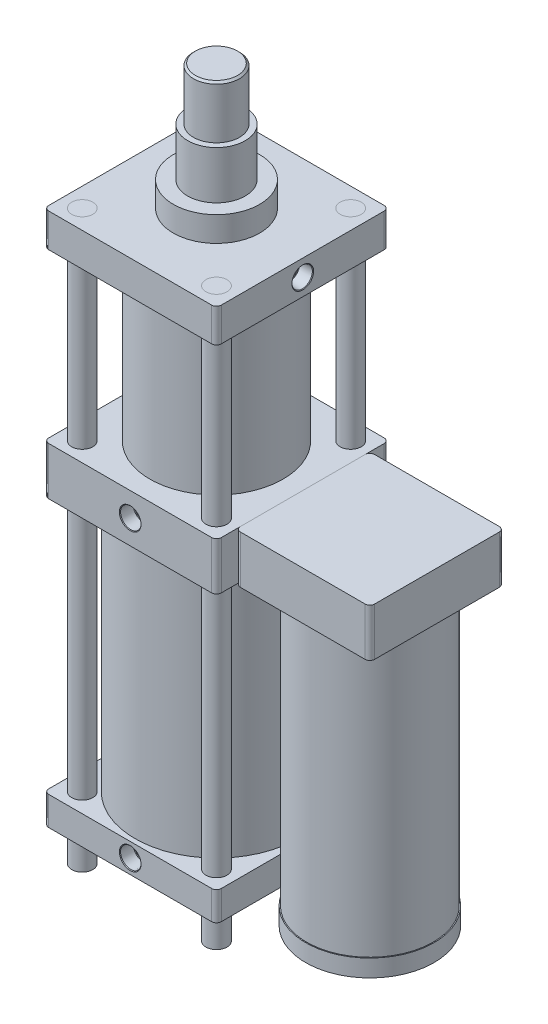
ISO-10303-21;
HEADER;
FILE_DESCRIPTION(('STEP AP214'),'2;1');
FILE_NAME('part.step','',(''),(''),'','','');
FILE_SCHEMA(('AUTOMOTIVE_DESIGN { 1 0 10303 214 1 1 1 1 }'));
ENDSEC;
DATA;
#1=APPLICATION_CONTEXT('core data for automotive mechanical design processes');
#2=APPLICATION_PROTOCOL_DEFINITION('international standard','automotive_design',2000,#1);
#3=PRODUCT_CONTEXT('',#1,'mechanical');
#4=PRODUCT('Part','Part','',(#3));
#5=PRODUCT_RELATED_PRODUCT_CATEGORY('part','',(#4));
#6=PRODUCT_DEFINITION_FORMATION('','',#4);
#7=PRODUCT_DEFINITION_CONTEXT('part definition',#1,'design');
#8=PRODUCT_DEFINITION('design','',#6,#7);
#9=PRODUCT_DEFINITION_SHAPE('','',#8);
#10=(LENGTH_UNIT() NAMED_UNIT(*) SI_UNIT(.MILLI.,.METRE.));
#11=(NAMED_UNIT(*) PLANE_ANGLE_UNIT() SI_UNIT($,.RADIAN.));
#12=(NAMED_UNIT(*) SI_UNIT($,.STERADIAN.) SOLID_ANGLE_UNIT());
#13=UNCERTAINTY_MEASURE_WITH_UNIT(LENGTH_MEASURE(1.E-05),#10,'distance_accuracy_value','');
#14=(GEOMETRIC_REPRESENTATION_CONTEXT(3) GLOBAL_UNCERTAINTY_ASSIGNED_CONTEXT((#13)) GLOBAL_UNIT_ASSIGNED_CONTEXT((#10,
#11,#12)) REPRESENTATION_CONTEXT('',''));
#15=CARTESIAN_POINT('',(0.,0.,0.));
#16=DIRECTION('',(0.,0.,1.));
#17=DIRECTION('',(1.,0.,0.));
#18=AXIS2_PLACEMENT_3D('',#15,#16,#17);
#19=CARTESIAN_POINT('',(70.,-557.,70.));
#20=DIRECTION('',(0.,1.,0.));
#21=DIRECTION('',(0.,0.,1.));
#22=AXIS2_PLACEMENT_3D('',#19,#20,#21);
#23=CYLINDRICAL_SURFACE('',#22,11.);
#24=CARTESIAN_POINT('',(70.,-557.,70.));
#25=DIRECTION('',(0.,-1.,0.));
#26=DIRECTION('',(0.,0.,-1.));
#27=AXIS2_PLACEMENT_3D('',#24,#25,#26);
#28=CIRCLE('',#27,11.);
#29=CARTESIAN_POINT('',(70.,-557.,59.));
#30=VERTEX_POINT('',#29);
#31=EDGE_CURVE('E11',#30,#30,#28,.T.);
#32=ORIENTED_EDGE('',*,*,#31,.F.);
#33=EDGE_LOOP('',(#32));
#34=FACE_BOUND('',#33,.T.);
#35=CARTESIAN_POINT('',(70.,35.,70.));
#36=DIRECTION('',(0.,1.,0.));
#37=DIRECTION('',(0.,0.,1.));
#38=AXIS2_PLACEMENT_3D('',#35,#36,#37);
#39=CIRCLE('',#38,11.);
#40=CARTESIAN_POINT('',(70.,35.,81.));
#41=VERTEX_POINT('',#40);
#42=EDGE_CURVE('E50',#41,#41,#39,.F.);
#43=ORIENTED_EDGE('',*,*,#42,.T.);
#44=EDGE_LOOP('',(#43));
#45=FACE_BOUND('',#44,.T.);
#46=ADVANCED_FACE('F44',(#34,#45),#23,.T.);
#47=CARTESIAN_POINT('',(70.,-557.,70.));
#48=DIRECTION('',(0.,-1.,0.));
#49=DIRECTION('',(0.,0.,-1.));
#50=AXIS2_PLACEMENT_3D('',#47,#48,#49);
#51=PLANE('',#50);
#52=ORIENTED_EDGE('',*,*,#31,.T.);
#53=EDGE_LOOP('',(#52));
#54=FACE_BOUND('',#53,.T.);
#55=ADVANCED_FACE('F59',(#54),#51,.T.);
#56=CARTESIAN_POINT('',(-85.,35.,85.));
#57=DIRECTION('',(0.,1.,0.));
#58=DIRECTION('',(0.,0.,1.));
#59=AXIS2_PLACEMENT_3D('',#56,#57,#58);
#60=PLANE('',#59);
#61=ORIENTED_EDGE('',*,*,#42,.F.);
#62=EDGE_LOOP('',(#61));
#63=FACE_BOUND('',#62,.T.);
#64=ADVANCED_FACE('F57',(#63),#60,.T.);
#65=CLOSED_SHELL('',(#46,#55,#64));
#66=MANIFOLD_SOLID_BREP('B2',#65);
#67=CARTESIAN_POINT('',(70.0000000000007,-557.,-69.9999999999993));
#68=DIRECTION('',(0.,1.,0.));
#69=DIRECTION('',(0.,0.,1.));
#70=AXIS2_PLACEMENT_3D('',#67,#68,#69);
#71=CYLINDRICAL_SURFACE('',#70,11.);
#72=CARTESIAN_POINT('',(70.0000000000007,-557.,-69.9999999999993));
#73=DIRECTION('',(0.,-1.,0.));
#74=DIRECTION('',(0.,0.,-1.));
#75=AXIS2_PLACEMENT_3D('',#72,#73,#74);
#76=CIRCLE('',#75,11.);
#77=CARTESIAN_POINT('',(70.0000000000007,-557.,-80.9999999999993));
#78=VERTEX_POINT('',#77);
#79=EDGE_CURVE('E43',#78,#78,#76,.T.);
#80=ORIENTED_EDGE('',*,*,#79,.F.);
#81=EDGE_LOOP('',(#80));
#82=FACE_BOUND('',#81,.T.);
#83=CARTESIAN_POINT('',(70.0000000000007,35.,-69.9999999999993));
#84=DIRECTION('',(0.,1.,0.));
#85=DIRECTION('',(0.,0.,1.));
#86=AXIS2_PLACEMENT_3D('',#83,#84,#85);
#87=CIRCLE('',#86,11.);
#88=CARTESIAN_POINT('',(70.0000000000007,35.,-58.9999999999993));
#89=VERTEX_POINT('',#88);
#90=EDGE_CURVE('E99',#89,#89,#87,.F.);
#91=ORIENTED_EDGE('',*,*,#90,.T.);
#92=EDGE_LOOP('',(#91));
#93=FACE_BOUND('',#92,.T.);
#94=ADVANCED_FACE('F93',(#82,#93),#71,.T.);
#95=CARTESIAN_POINT('',(70.0000000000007,-557.,-69.9999999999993));
#96=DIRECTION('',(0.,-1.,0.));
#97=DIRECTION('',(0.,0.,-1.));
#98=AXIS2_PLACEMENT_3D('',#95,#96,#97);
#99=PLANE('',#98);
#100=ORIENTED_EDGE('',*,*,#79,.T.);
#101=EDGE_LOOP('',(#100));
#102=FACE_BOUND('',#101,.T.);
#103=ADVANCED_FACE('F108',(#102),#99,.T.);
#104=CARTESIAN_POINT('',(-85.,35.,85.));
#105=DIRECTION('',(0.,1.,0.));
#106=DIRECTION('',(0.,0.,1.));
#107=AXIS2_PLACEMENT_3D('',#104,#105,#106);
#108=PLANE('',#107);
#109=ORIENTED_EDGE('',*,*,#90,.F.);
#110=EDGE_LOOP('',(#109));
#111=FACE_BOUND('',#110,.T.);
#112=ADVANCED_FACE('F106',(#111),#108,.T.);
#113=CLOSED_SHELL('',(#94,#103,#112));
#114=MANIFOLD_SOLID_BREP('B6',#113);
#115=CARTESIAN_POINT('',(-70.0000000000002,-557.,69.9999999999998));
#116=DIRECTION('',(0.,1.,0.));
#117=DIRECTION('',(0.,0.,1.));
#118=AXIS2_PLACEMENT_3D('',#115,#116,#117);
#119=CYLINDRICAL_SURFACE('',#118,11.);
#120=CARTESIAN_POINT('',(-70.0000000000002,-557.,69.9999999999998));
#121=DIRECTION('',(0.,-1.,0.));
#122=DIRECTION('',(0.,0.,-1.));
#123=AXIS2_PLACEMENT_3D('',#120,#121,#122);
#124=CIRCLE('',#123,11.);
#125=CARTESIAN_POINT('',(-70.0000000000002,-557.,58.9999999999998));
#126=VERTEX_POINT('',#125);
#127=EDGE_CURVE('E92',#126,#126,#124,.T.);
#128=ORIENTED_EDGE('',*,*,#127,.F.);
#129=EDGE_LOOP('',(#128));
#130=FACE_BOUND('',#129,.T.);
#131=CARTESIAN_POINT('',(-70.0000000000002,35.,69.9999999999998));
#132=DIRECTION('',(0.,1.,0.));
#133=DIRECTION('',(0.,0.,1.));
#134=AXIS2_PLACEMENT_3D('',#131,#132,#133);
#135=CIRCLE('',#134,11.);
#136=CARTESIAN_POINT('',(-70.0000000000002,35.,80.9999999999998));
#137=VERTEX_POINT('',#136);
#138=EDGE_CURVE('E148',#137,#137,#135,.F.);
#139=ORIENTED_EDGE('',*,*,#138,.T.);
#140=EDGE_LOOP('',(#139));
#141=FACE_BOUND('',#140,.T.);
#142=ADVANCED_FACE('F142',(#130,#141),#119,.T.);
#143=CARTESIAN_POINT('',(-70.0000000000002,-557.,69.9999999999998));
#144=DIRECTION('',(0.,-1.,0.));
#145=DIRECTION('',(0.,0.,-1.));
#146=AXIS2_PLACEMENT_3D('',#143,#144,#145);
#147=PLANE('',#146);
#148=ORIENTED_EDGE('',*,*,#127,.T.);
#149=EDGE_LOOP('',(#148));
#150=FACE_BOUND('',#149,.T.);
#151=ADVANCED_FACE('F157',(#150),#147,.T.);
#152=CARTESIAN_POINT('',(-85.,35.,85.));
#153=DIRECTION('',(0.,1.,0.));
#154=DIRECTION('',(0.,0.,1.));
#155=AXIS2_PLACEMENT_3D('',#152,#153,#154);
#156=PLANE('',#155);
#157=ORIENTED_EDGE('',*,*,#138,.F.);
#158=EDGE_LOOP('',(#157));
#159=FACE_BOUND('',#158,.T.);
#160=ADVANCED_FACE('F155',(#159),#156,.T.);
#161=CLOSED_SHELL('',(#142,#151,#160));
#162=MANIFOLD_SOLID_BREP('B38',#161);
#163=CARTESIAN_POINT('',(-69.9999999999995,-557.,-70.0000000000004));
#164=DIRECTION('',(0.,1.,0.));
#165=DIRECTION('',(0.,0.,1.));
#166=AXIS2_PLACEMENT_3D('',#163,#164,#165);
#167=CYLINDRICAL_SURFACE('',#166,11.);
#168=CARTESIAN_POINT('',(-69.9999999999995,-557.,-70.0000000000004));
#169=DIRECTION('',(0.,-1.,0.));
#170=DIRECTION('',(0.,0.,-1.));
#171=AXIS2_PLACEMENT_3D('',#168,#169,#170);
#172=CIRCLE('',#171,11.);
#173=CARTESIAN_POINT('',(-69.9999999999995,-557.,-81.0000000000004));
#174=VERTEX_POINT('',#173);
#175=EDGE_CURVE('E141',#174,#174,#172,.T.);
#176=ORIENTED_EDGE('',*,*,#175,.F.);
#177=EDGE_LOOP('',(#176));
#178=FACE_BOUND('',#177,.T.);
#179=CARTESIAN_POINT('',(-69.9999999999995,35.,-70.0000000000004));
#180=DIRECTION('',(0.,1.,0.));
#181=DIRECTION('',(0.,0.,1.));
#182=AXIS2_PLACEMENT_3D('',#179,#180,#181);
#183=CIRCLE('',#182,11.);
#184=CARTESIAN_POINT('',(-69.9999999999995,35.,-59.0000000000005));
#185=VERTEX_POINT('',#184);
#186=EDGE_CURVE('E199',#185,#185,#183,.F.);
#187=ORIENTED_EDGE('',*,*,#186,.T.);
#188=EDGE_LOOP('',(#187));
#189=FACE_BOUND('',#188,.T.);
#190=ADVANCED_FACE('F193',(#178,#189),#167,.T.);
#191=CARTESIAN_POINT('',(-69.9999999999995,-557.,-70.0000000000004));
#192=DIRECTION('',(0.,-1.,0.));
#193=DIRECTION('',(0.,0.,-1.));
#194=AXIS2_PLACEMENT_3D('',#191,#192,#193);
#195=PLANE('',#194);
#196=ORIENTED_EDGE('',*,*,#175,.T.);
#197=EDGE_LOOP('',(#196));
#198=FACE_BOUND('',#197,.T.);
#199=ADVANCED_FACE('F208',(#198),#195,.T.);
#200=CARTESIAN_POINT('',(-85.,35.,85.));
#201=DIRECTION('',(0.,1.,0.));
#202=DIRECTION('',(0.,0.,1.));
#203=AXIS2_PLACEMENT_3D('',#200,#201,#202);
#204=PLANE('',#203);
#205=ORIENTED_EDGE('',*,*,#186,.F.);
#206=EDGE_LOOP('',(#205));
#207=FACE_BOUND('',#206,.T.);
#208=ADVANCED_FACE('F206',(#207),#204,.T.);
#209=CLOSED_SHELL('',(#190,#199,#208));
#210=MANIFOLD_SOLID_BREP('B87',#209);
#211=CARTESIAN_POINT('',(168.660254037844,-545.,-15.));
#212=DIRECTION('',(-0.866025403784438,0.,0.5));
#213=DIRECTION('',(0.5,0.,0.866025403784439));
#214=AXIS2_PLACEMENT_3D('',#211,#212,#213);
#215=PLANE('',#214);
#216=DIRECTION('',(0.5,0.,0.866025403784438));
#217=VECTOR('',#216,1.);
#218=CARTESIAN_POINT('',(168.660254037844,-533.,-15.));
#219=LINE('',#218,#217);
#220=CARTESIAN_POINT('',(168.660254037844,-533.,-15.));
#221=VERTEX_POINT('',#220);
#222=CARTESIAN_POINT('',(177.320508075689,-533.,0.));
#223=VERTEX_POINT('',#222);
#224=EDGE_CURVE('E329',#221,#223,#219,.T.);
#225=ORIENTED_EDGE('',*,*,#224,.T.);
#226=DIRECTION('',(0.,1.,0.));
#227=VECTOR('',#226,1.);
#228=CARTESIAN_POINT('',(177.320508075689,-545.,0.));
#229=LINE('',#228,#227);
#230=CARTESIAN_POINT('',(177.320508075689,-545.,0.));
#231=VERTEX_POINT('',#230);
#232=EDGE_CURVE('E191',#231,#223,#229,.T.);
#233=ORIENTED_EDGE('',*,*,#232,.F.);
#234=DIRECTION('',(0.5,0.,0.866025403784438));
#235=VECTOR('',#234,1.);
#236=CARTESIAN_POINT('',(168.660254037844,-545.,-15.));
#237=LINE('',#236,#235);
#238=CARTESIAN_POINT('',(168.660254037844,-545.,-15.));
#239=VERTEX_POINT('',#238);
#240=EDGE_CURVE('E339',#239,#231,#237,.T.);
#241=ORIENTED_EDGE('',*,*,#240,.F.);
#242=DIRECTION('',(0.,1.,0.));
#243=VECTOR('',#242,1.);
#244=CARTESIAN_POINT('',(168.660254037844,-545.,-15.));
#245=LINE('',#244,#243);
#246=EDGE_CURVE('E325',#239,#221,#245,.T.);
#247=ORIENTED_EDGE('',*,*,#246,.T.);
#248=EDGE_LOOP('',(#225,#233,#241,#247));
#249=FACE_BOUND('',#248,.T.);
#250=ADVANCED_FACE('F244',(#249),#215,.F.);
#251=CARTESIAN_POINT('',(177.320508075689,-545.,0.));
#252=DIRECTION('',(-0.866025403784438,0.,-0.5));
#253=DIRECTION('',(-0.5,0.,0.866025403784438));
#254=AXIS2_PLACEMENT_3D('',#251,#252,#253);
#255=PLANE('',#254);
#256=DIRECTION('',(-0.5,0.,0.866025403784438));
#257=VECTOR('',#256,1.);
#258=CARTESIAN_POINT('',(177.320508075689,-533.,0.));
#259=LINE('',#258,#257);
#260=CARTESIAN_POINT('',(168.660254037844,-533.,14.9999999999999));
#261=VERTEX_POINT('',#260);
#262=EDGE_CURVE('E332',#223,#261,#259,.T.);
#263=ORIENTED_EDGE('',*,*,#262,.T.);
#264=DIRECTION('',(0.,1.,0.));
#265=VECTOR('',#264,1.);
#266=CARTESIAN_POINT('',(168.660254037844,-545.,14.9999999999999));
#267=LINE('',#266,#265);
#268=CARTESIAN_POINT('',(168.660254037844,-545.,14.9999999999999));
#269=VERTEX_POINT('',#268);
#270=EDGE_CURVE('E253',#269,#261,#267,.T.);
#271=ORIENTED_EDGE('',*,*,#270,.F.);
#272=DIRECTION('',(-0.5,0.,0.866025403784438));
#273=VECTOR('',#272,1.);
#274=CARTESIAN_POINT('',(177.320508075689,-545.,0.));
#275=LINE('',#274,#273);
#276=EDGE_CURVE('E298',#231,#269,#275,.T.);
#277=ORIENTED_EDGE('',*,*,#276,.F.);
#278=ORIENTED_EDGE('',*,*,#232,.T.);
#279=EDGE_LOOP('',(#263,#271,#277,#278));
#280=FACE_BOUND('',#279,.T.);
#281=ADVANCED_FACE('F365',(#280),#255,.F.);
#282=CARTESIAN_POINT('',(168.660254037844,-545.,14.9999999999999));
#283=DIRECTION('',(0.,0.,-1.));
#284=DIRECTION('',(-1.,0.,0.));
#285=AXIS2_PLACEMENT_3D('',#282,#283,#284);
#286=PLANE('',#285);
#287=DIRECTION('',(-1.,0.,0.));
#288=VECTOR('',#287,1.);
#289=CARTESIAN_POINT('',(168.660254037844,-533.,14.9999999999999));
#290=LINE('',#289,#288);
#291=CARTESIAN_POINT('',(151.339745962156,-533.,14.9999999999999));
#292=VERTEX_POINT('',#291);
#293=EDGE_CURVE('E334',#261,#292,#290,.T.);
#294=ORIENTED_EDGE('',*,*,#293,.T.);
#295=DIRECTION('',(0.,1.,0.));
#296=VECTOR('',#295,1.);
#297=CARTESIAN_POINT('',(151.339745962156,-545.,14.9999999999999));
#298=LINE('',#297,#296);
#299=CARTESIAN_POINT('',(151.339745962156,-545.,14.9999999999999));
#300=VERTEX_POINT('',#299);
#301=EDGE_CURVE('E320',#300,#292,#298,.T.);
#302=ORIENTED_EDGE('',*,*,#301,.F.);
#303=DIRECTION('',(-1.,0.,0.));
#304=VECTOR('',#303,1.);
#305=CARTESIAN_POINT('',(168.660254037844,-545.,14.9999999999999));
#306=LINE('',#305,#304);
#307=EDGE_CURVE('E311',#269,#300,#306,.T.);
#308=ORIENTED_EDGE('',*,*,#307,.F.);
#309=ORIENTED_EDGE('',*,*,#270,.T.);
#310=EDGE_LOOP('',(#294,#302,#308,#309));
#311=FACE_BOUND('',#310,.T.);
#312=ADVANCED_FACE('F346',(#311),#286,.F.);
#313=CARTESIAN_POINT('',(151.339745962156,-545.,14.9999999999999));
#314=DIRECTION('',(0.866025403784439,0.,-0.5));
#315=DIRECTION('',(-0.5,0.,-0.866025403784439));
#316=AXIS2_PLACEMENT_3D('',#313,#314,#315);
#317=PLANE('',#316);
#318=DIRECTION('',(-0.5,0.,-0.866025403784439));
#319=VECTOR('',#318,1.);
#320=CARTESIAN_POINT('',(151.339745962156,-533.,14.9999999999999));
#321=LINE('',#320,#319);
#322=CARTESIAN_POINT('',(142.679491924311,-533.,0.));
#323=VERTEX_POINT('',#322);
#324=EDGE_CURVE('E319',#292,#323,#321,.T.);
#325=ORIENTED_EDGE('',*,*,#324,.T.);
#326=DIRECTION('',(0.,1.,0.));
#327=VECTOR('',#326,1.);
#328=CARTESIAN_POINT('',(142.679491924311,-545.,0.));
#329=LINE('',#328,#327);
#330=CARTESIAN_POINT('',(142.679491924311,-545.,0.));
#331=VERTEX_POINT('',#330);
#332=EDGE_CURVE('E316',#331,#323,#329,.T.);
#333=ORIENTED_EDGE('',*,*,#332,.F.);
#334=DIRECTION('',(-0.5,0.,-0.866025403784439));
#335=VECTOR('',#334,1.);
#336=CARTESIAN_POINT('',(151.339745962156,-545.,14.9999999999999));
#337=LINE('',#336,#335);
#338=EDGE_CURVE('E305',#300,#331,#337,.T.);
#339=ORIENTED_EDGE('',*,*,#338,.F.);
#340=ORIENTED_EDGE('',*,*,#301,.T.);
#341=EDGE_LOOP('',(#325,#333,#339,#340));
#342=FACE_BOUND('',#341,.T.);
#343=ADVANCED_FACE('F317',(#342),#317,.F.);
#344=CARTESIAN_POINT('',(142.679491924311,-545.,0.));
#345=DIRECTION('',(0.866025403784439,0.,0.5));
#346=DIRECTION('',(0.5,0.,-0.866025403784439));
#347=AXIS2_PLACEMENT_3D('',#344,#345,#346);
#348=PLANE('',#347);
#349=DIRECTION('',(0.5,0.,-0.866025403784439));
#350=VECTOR('',#349,1.);
#351=CARTESIAN_POINT('',(142.679491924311,-533.,0.));
#352=LINE('',#351,#350);
#353=CARTESIAN_POINT('',(151.339745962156,-533.,-15.));
#354=VERTEX_POINT('',#353);
#355=EDGE_CURVE('E284',#323,#354,#352,.T.);
#356=ORIENTED_EDGE('',*,*,#355,.T.);
#357=DIRECTION('',(0.,1.,0.));
#358=VECTOR('',#357,1.);
#359=CARTESIAN_POINT('',(151.339745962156,-545.,-15.));
#360=LINE('',#359,#358);
#361=CARTESIAN_POINT('',(151.339745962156,-545.,-15.));
#362=VERTEX_POINT('',#361);
#363=EDGE_CURVE('E321',#362,#354,#360,.T.);
#364=ORIENTED_EDGE('',*,*,#363,.F.);
#365=DIRECTION('',(0.5,0.,-0.866025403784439));
#366=VECTOR('',#365,1.);
#367=CARTESIAN_POINT('',(142.679491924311,-545.,0.));
#368=LINE('',#367,#366);
#369=EDGE_CURVE('E309',#331,#362,#368,.T.);
#370=ORIENTED_EDGE('',*,*,#369,.F.);
#371=ORIENTED_EDGE('',*,*,#332,.T.);
#372=EDGE_LOOP('',(#356,#364,#370,#371));
#373=FACE_BOUND('',#372,.T.);
#374=ADVANCED_FACE('F323',(#373),#348,.F.);
#375=CARTESIAN_POINT('',(151.339745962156,-545.,-15.));
#376=DIRECTION('',(0.,0.,1.));
#377=DIRECTION('',(1.,0.,0.));
#378=AXIS2_PLACEMENT_3D('',#375,#376,#377);
#379=PLANE('',#378);
#380=DIRECTION('',(1.,0.,0.));
#381=VECTOR('',#380,1.);
#382=CARTESIAN_POINT('',(151.339745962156,-533.,-15.));
#383=LINE('',#382,#381);
#384=EDGE_CURVE('E290',#354,#221,#383,.T.);
#385=ORIENTED_EDGE('',*,*,#384,.T.);
#386=ORIENTED_EDGE('',*,*,#246,.F.);
#387=DIRECTION('',(1.,0.,0.));
#388=VECTOR('',#387,1.);
#389=CARTESIAN_POINT('',(151.339745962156,-545.,-15.));
#390=LINE('',#389,#388);
#391=EDGE_CURVE('E261',#362,#239,#390,.T.);
#392=ORIENTED_EDGE('',*,*,#391,.F.);
#393=ORIENTED_EDGE('',*,*,#363,.T.);
#394=EDGE_LOOP('',(#385,#386,#392,#393));
#395=FACE_BOUND('',#394,.T.);
#396=ADVANCED_FACE('F353',(#395),#379,.F.);
#397=CARTESIAN_POINT('',(0.,-545.,0.));
#398=DIRECTION('',(0.,-1.,0.));
#399=DIRECTION('',(0.,0.,-1.));
#400=AXIS2_PLACEMENT_3D('',#397,#398,#399);
#401=PLANE('',#400);
#402=CARTESIAN_POINT('',(160.,-545.,0.));
#403=DIRECTION('',(0.,-1.,0.));
#404=DIRECTION('',(0.,0.,-1.));
#405=AXIS2_PLACEMENT_3D('',#402,#403,#404);
#406=CIRCLE('',#405,11.3029619);
#407=CARTESIAN_POINT('',(160.,-545.,-11.3029619));
#408=VERTEX_POINT('',#407);
#409=EDGE_CURVE('E431',#408,#408,#406,.T.);
#410=ORIENTED_EDGE('',*,*,#409,.F.);
#411=EDGE_LOOP('',(#410));
#412=FACE_BOUND('',#411,.T.);
#413=ORIENTED_EDGE('',*,*,#240,.T.);
#414=ORIENTED_EDGE('',*,*,#276,.T.);
#415=ORIENTED_EDGE('',*,*,#307,.T.);
#416=ORIENTED_EDGE('',*,*,#338,.T.);
#417=ORIENTED_EDGE('',*,*,#369,.T.);
#418=ORIENTED_EDGE('',*,*,#391,.T.);
#419=EDGE_LOOP('',(#413,#414,#415,#416,#417,#418));
#420=FACE_BOUND('',#419,.T.);
#421=ADVANCED_FACE('F307',(#412,#420),#401,.T.);
#422=CARTESIAN_POINT('',(0.,-533.,0.));
#423=DIRECTION('',(0.,-1.,0.));
#424=DIRECTION('',(0.,0.,-1.));
#425=AXIS2_PLACEMENT_3D('',#422,#423,#424);
#426=PLANE('',#425);
#427=CARTESIAN_POINT('',(160.,-533.,0.));
#428=DIRECTION('',(0.,-1.,0.));
#429=DIRECTION('',(0.,0.,-1.));
#430=AXIS2_PLACEMENT_3D('',#427,#428,#429);
#431=CIRCLE('',#430,10.3276785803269);
#432=CARTESIAN_POINT('',(160.,-533.,-10.3276785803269));
#433=VERTEX_POINT('',#432);
#434=EDGE_CURVE('E247',#433,#433,#431,.T.);
#435=ORIENTED_EDGE('',*,*,#434,.T.);
#436=EDGE_LOOP('',(#435));
#437=FACE_BOUND('',#436,.T.);
#438=ORIENTED_EDGE('',*,*,#224,.F.);
#439=ORIENTED_EDGE('',*,*,#384,.F.);
#440=ORIENTED_EDGE('',*,*,#355,.F.);
#441=ORIENTED_EDGE('',*,*,#324,.F.);
#442=ORIENTED_EDGE('',*,*,#293,.F.);
#443=ORIENTED_EDGE('',*,*,#262,.F.);
#444=EDGE_LOOP('',(#438,#439,#440,#441,#442,#443));
#445=FACE_BOUND('',#444,.T.);
#446=ADVANCED_FACE('F349',(#437,#445),#426,.F.);
#447=CARTESIAN_POINT('',(160.,-544.365,0.));
#448=DIRECTION('',(0.,-1.,0.));
#449=DIRECTION('',(0.,0.,-1.));
#450=AXIS2_PLACEMENT_3D('',#447,#448,#449);
#451=CONICAL_SURFACE('',#450,10.6679619,0.0299323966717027);
#452=CARTESIAN_POINT('',(160.,-544.365,0.));
#453=DIRECTION('',(0.,-1.,0.));
#454=DIRECTION('',(0.,0.,-1.));
#455=AXIS2_PLACEMENT_3D('',#452,#453,#454);
#456=CIRCLE('',#455,10.6679619);
#457=CARTESIAN_POINT('',(160.,-544.365,-10.6679619));
#458=VERTEX_POINT('',#457);
#459=EDGE_CURVE('E428',#458,#458,#456,.T.);
#460=ORIENTED_EDGE('',*,*,#459,.T.);
#461=EDGE_LOOP('',(#460));
#462=FACE_BOUND('',#461,.T.);
#463=ORIENTED_EDGE('',*,*,#434,.F.);
#464=EDGE_LOOP('',(#463));
#465=FACE_BOUND('',#464,.T.);
#466=ADVANCED_FACE('F402',(#462,#465),#451,.F.);
#467=CARTESIAN_POINT('',(160.,-545.,0.));
#468=DIRECTION('',(0.,-1.,0.));
#469=DIRECTION('',(0.,0.,-1.));
#470=AXIS2_PLACEMENT_3D('',#467,#468,#469);
#471=CONICAL_SURFACE('',#470,11.3029619,0.785398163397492);
#472=ORIENTED_EDGE('',*,*,#459,.F.);
#473=EDGE_LOOP('',(#472));
#474=FACE_BOUND('',#473,.T.);
#475=ORIENTED_EDGE('',*,*,#409,.T.);
#476=EDGE_LOOP('',(#475));
#477=FACE_BOUND('',#476,.T.);
#478=ADVANCED_FACE('F411',(#474,#477),#471,.F.);
#479=CLOSED_SHELL('',(#250,#281,#312,#343,#374,#396,#421,#446,#466,#478));
#480=MANIFOLD_SOLID_BREP('B136',#479);
#481=CARTESIAN_POINT('',(160.,-533.,0.));
#482=DIRECTION('',(0.,1.,0.));
#483=DIRECTION('',(0.,0.,1.));
#484=AXIS2_PLACEMENT_3D('',#481,#482,#483);
#485=CYLINDRICAL_SURFACE('',#484,67.);
#486=CARTESIAN_POINT('',(160.,-533.,0.));
#487=DIRECTION('',(0.,-1.,0.));
#488=DIRECTION('',(0.,0.,-1.));
#489=AXIS2_PLACEMENT_3D('',#486,#487,#488);
#490=CIRCLE('',#489,67.);
#491=CARTESIAN_POINT('',(160.,-533.,-67.0000000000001));
#492=VERTEX_POINT('',#491);
#493=EDGE_CURVE('E242',#492,#492,#490,.T.);
#494=ORIENTED_EDGE('',*,*,#493,.F.);
#495=EDGE_LOOP('',(#494));
#496=FACE_BOUND('',#495,.T.);
#497=CARTESIAN_POINT('',(160.,-515.,0.));
#498=DIRECTION('',(0.,-1.,0.));
#499=DIRECTION('',(0.,0.,-1.));
#500=AXIS2_PLACEMENT_3D('',#497,#498,#499);
#501=CIRCLE('',#500,67.);
#502=CARTESIAN_POINT('',(160.,-515.,-67.0000000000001));
#503=VERTEX_POINT('',#502);
#504=EDGE_CURVE('E471',#503,#503,#501,.T.);
#505=ORIENTED_EDGE('',*,*,#504,.T.);
#506=EDGE_LOOP('',(#505));
#507=FACE_BOUND('',#506,.T.);
#508=ADVANCED_FACE('F464',(#496,#507),#485,.T.);
#509=CARTESIAN_POINT('',(160.,-533.,0.));
#510=DIRECTION('',(0.,-1.,0.));
#511=DIRECTION('',(0.,0.,-1.));
#512=AXIS2_PLACEMENT_3D('',#509,#510,#511);
#513=PLANE('',#512);
#514=CARTESIAN_POINT('',(160.,-533.,0.));
#515=DIRECTION('',(0.,-1.,0.));
#516=DIRECTION('',(0.,0.,-1.));
#517=AXIS2_PLACEMENT_3D('',#514,#515,#516);
#518=CIRCLE('',#517,10.3276785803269);
#519=CARTESIAN_POINT('',(160.,-533.,-10.3276785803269));
#520=VERTEX_POINT('',#519);
#521=EDGE_CURVE('E467',#520,#520,#518,.T.);
#522=ORIENTED_EDGE('',*,*,#521,.F.);
#523=EDGE_LOOP('',(#522));
#524=FACE_BOUND('',#523,.T.);
#525=ORIENTED_EDGE('',*,*,#493,.T.);
#526=EDGE_LOOP('',(#525));
#527=FACE_BOUND('',#526,.T.);
#528=ADVANCED_FACE('F497',(#524,#527),#513,.T.);
#529=CARTESIAN_POINT('',(160.,-515.,0.));
#530=DIRECTION('',(0.,-1.,0.));
#531=DIRECTION('',(0.,0.,-1.));
#532=AXIS2_PLACEMENT_3D('',#529,#530,#531);
#533=PLANE('',#532);
#534=ORIENTED_EDGE('',*,*,#504,.F.);
#535=EDGE_LOOP('',(#534));
#536=FACE_BOUND('',#535,.T.);
#537=ADVANCED_FACE('F479',(#536),#533,.F.);
#538=CARTESIAN_POINT('',(160.,-522.36,0.));
#539=DIRECTION('',(0.,-1.,0.));
#540=DIRECTION('',(0.,0.,-1.));
#541=AXIS2_PLACEMENT_3D('',#538,#539,#540);
#542=CONICAL_SURFACE('',#541,8.92809999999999,1.02974425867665);
#543=CARTESIAN_POINT('',(160.,-516.99545630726,0.));
#544=VERTEX_POINT('',#543);
#545=VERTEX_LOOP('',#544);
#546=FACE_BOUND('',#545,.T.);
#547=CARTESIAN_POINT('',(160.,-522.36,0.));
#548=DIRECTION('',(0.,-1.,0.));
#549=DIRECTION('',(0.,0.,-1.));
#550=AXIS2_PLACEMENT_3D('',#547,#548,#549);
#551=CIRCLE('',#550,8.92809999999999);
#552=CARTESIAN_POINT('',(160.,-522.36,-8.92810000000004));
#553=VERTEX_POINT('',#552);
#554=EDGE_CURVE('E483',#553,#553,#551,.T.);
#555=ORIENTED_EDGE('',*,*,#554,.T.);
#556=EDGE_LOOP('',(#555));
#557=FACE_BOUND('',#556,.T.);
#558=ADVANCED_FACE('F475',(#546,#557),#542,.F.);
#559=CARTESIAN_POINT('',(160.,-545.,0.));
#560=DIRECTION('',(0.,-1.,0.));
#561=DIRECTION('',(0.,0.,-1.));
#562=AXIS2_PLACEMENT_3D('',#559,#560,#561);
#563=CYLINDRICAL_SURFACE('',#562,8.92809999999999);
#564=ORIENTED_EDGE('',*,*,#554,.F.);
#565=EDGE_LOOP('',(#564));
#566=FACE_BOUND('',#565,.T.);
#567=CARTESIAN_POINT('',(160.,-531.43,0.));
#568=DIRECTION('',(0.,-1.,0.));
#569=DIRECTION('',(0.,0.,-1.));
#570=AXIS2_PLACEMENT_3D('',#567,#568,#569);
#571=CIRCLE('',#570,8.92809999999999);
#572=CARTESIAN_POINT('',(160.,-531.43,-8.92810000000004));
#573=VERTEX_POINT('',#572);
#574=EDGE_CURVE('E485',#573,#573,#571,.T.);
#575=ORIENTED_EDGE('',*,*,#574,.T.);
#576=EDGE_LOOP('',(#575));
#577=FACE_BOUND('',#576,.T.);
#578=ADVANCED_FACE('F478',(#566,#577),#563,.F.);
#579=CARTESIAN_POINT('',(168.9281,-531.43,0.));
#580=DIRECTION('',(0.,1.,0.));
#581=DIRECTION('',(0.,0.,1.));
#582=AXIS2_PLACEMENT_3D('',#579,#580,#581);
#583=PLANE('',#582);
#584=ORIENTED_EDGE('',*,*,#574,.F.);
#585=EDGE_LOOP('',(#584));
#586=FACE_BOUND('',#585,.T.);
#587=CARTESIAN_POINT('',(160.,-531.43,0.));
#588=DIRECTION('',(0.,-1.,0.));
#589=DIRECTION('',(0.,0.,-1.));
#590=AXIS2_PLACEMENT_3D('',#587,#588,#589);
#591=CIRCLE('',#590,10.2806706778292);
#592=CARTESIAN_POINT('',(160.,-531.43,-10.2806706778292));
#593=VERTEX_POINT('',#592);
#594=EDGE_CURVE('E489',#593,#593,#591,.T.);
#595=ORIENTED_EDGE('',*,*,#594,.T.);
#596=EDGE_LOOP('',(#595));
#597=FACE_BOUND('',#596,.T.);
#598=ADVANCED_FACE('F530',(#586,#597),#583,.F.);
#599=CARTESIAN_POINT('',(160.,-544.365,0.));
#600=DIRECTION('',(0.,-1.,0.));
#601=DIRECTION('',(0.,0.,-1.));
#602=AXIS2_PLACEMENT_3D('',#599,#600,#601);
#603=CONICAL_SURFACE('',#602,10.6679619,0.0299323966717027);
#604=ORIENTED_EDGE('',*,*,#521,.T.);
#605=EDGE_LOOP('',(#604));
#606=FACE_BOUND('',#605,.T.);
#607=ORIENTED_EDGE('',*,*,#594,.F.);
#608=EDGE_LOOP('',(#607));
#609=FACE_BOUND('',#608,.T.);
#610=ADVANCED_FACE('F539',(#606,#609),#603,.F.);
#611=CLOSED_SHELL('',(#508,#528,#537,#558,#578,#598,#610));
#612=MANIFOLD_SOLID_BREP('B185',#611);
#613=CARTESIAN_POINT('',(160.,-515.,0.));
#614=DIRECTION('',(0.,1.,0.));
#615=DIRECTION('',(0.,0.,1.));
#616=AXIS2_PLACEMENT_3D('',#613,#614,#615);
#617=CYLINDRICAL_SURFACE('',#616,66.);
#618=CARTESIAN_POINT('',(160.,-515.,0.));
#619=DIRECTION('',(0.,-1.,0.));
#620=DIRECTION('',(0.,0.,-1.));
#621=AXIS2_PLACEMENT_3D('',#618,#619,#620);
#622=CIRCLE('',#621,66.);
#623=CARTESIAN_POINT('',(160.,-515.,-66.0000000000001));
#624=VERTEX_POINT('',#623);
#625=EDGE_CURVE('E463',#624,#624,#622,.T.);
#626=ORIENTED_EDGE('',*,*,#625,.F.);
#627=EDGE_LOOP('',(#626));
#628=FACE_BOUND('',#627,.T.);
#629=CARTESIAN_POINT('',(160.,-225.,0.));
#630=DIRECTION('',(0.,-1.,0.));
#631=DIRECTION('',(0.,0.,-1.));
#632=AXIS2_PLACEMENT_3D('',#629,#630,#631);
#633=CIRCLE('',#632,66.);
#634=CARTESIAN_POINT('',(160.,-225.,-66.0000000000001));
#635=VERTEX_POINT('',#634);
#636=EDGE_CURVE('E580',#635,#635,#633,.T.);
#637=ORIENTED_EDGE('',*,*,#636,.T.);
#638=EDGE_LOOP('',(#637));
#639=FACE_BOUND('',#638,.T.);
#640=ADVANCED_FACE('F577',(#628,#639),#617,.T.);
#641=CARTESIAN_POINT('',(160.,-515.,0.));
#642=DIRECTION('',(0.,-1.,0.));
#643=DIRECTION('',(0.,0.,-1.));
#644=AXIS2_PLACEMENT_3D('',#641,#642,#643);
#645=PLANE('',#644);
#646=ORIENTED_EDGE('',*,*,#625,.T.);
#647=EDGE_LOOP('',(#646));
#648=FACE_BOUND('',#647,.T.);
#649=ADVANCED_FACE('F592',(#648),#645,.T.);
#650=CARTESIAN_POINT('',(160.,-225.,0.));
#651=DIRECTION('',(0.,-1.,0.));
#652=DIRECTION('',(0.,0.,-1.));
#653=AXIS2_PLACEMENT_3D('',#650,#651,#652);
#654=PLANE('',#653);
#655=ORIENTED_EDGE('',*,*,#636,.F.);
#656=EDGE_LOOP('',(#655));
#657=FACE_BOUND('',#656,.T.);
#658=ADVANCED_FACE('F590',(#657),#654,.F.);
#659=CLOSED_SHELL('',(#640,#649,#658));
#660=MANIFOLD_SOLID_BREP('B236',#659);
#661=CARTESIAN_POINT('',(-85.,-225.,-85.));
#662=DIRECTION('',(0.,-1.,0.));
#663=DIRECTION('',(0.,0.,-1.));
#664=AXIS2_PLACEMENT_3D('',#661,#662,#663);
#665=PLANE('',#664);
#666=CARTESIAN_POINT('',(95.,-225.,-65.));
#667=DIRECTION('',(0.,-1.,0.));
#668=DIRECTION('',(0.,0.,-1.));
#669=AXIS2_PLACEMENT_3D('',#666,#667,#668);
#670=CIRCLE('',#669,5.);
#671=CARTESIAN_POINT('',(95.0000000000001,-225.,-70.));
#672=VERTEX_POINT('',#671);
#673=CARTESIAN_POINT('',(90.,-225.,-65.));
#674=VERTEX_POINT('',#673);
#675=EDGE_CURVE('E636',#672,#674,#670,.F.);
#676=ORIENTED_EDGE('',*,*,#675,.F.);
#677=DIRECTION('',(-1.,0.,0.));
#678=VECTOR('',#677,1.);
#679=CARTESIAN_POINT('',(225.,-225.,-70.0000000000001));
#680=LINE('',#679,#678);
#681=CARTESIAN_POINT('',(225.,-225.,-70.0000000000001));
#682=VERTEX_POINT('',#681);
#683=EDGE_CURVE('E722',#682,#672,#680,.T.);
#684=ORIENTED_EDGE('',*,*,#683,.F.);
#685=CARTESIAN_POINT('',(225.,-225.,-65.0000000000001));
#686=DIRECTION('',(0.,-1.,0.));
#687=DIRECTION('',(0.,0.,-1.));
#688=AXIS2_PLACEMENT_3D('',#685,#686,#687);
#689=CIRCLE('',#688,5.);
#690=CARTESIAN_POINT('',(230.,-225.,-65.0000000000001));
#691=VERTEX_POINT('',#690);
#692=EDGE_CURVE('E726',#691,#682,#689,.F.);
#693=ORIENTED_EDGE('',*,*,#692,.F.);
#694=DIRECTION('',(0.,0.,-1.));
#695=VECTOR('',#694,1.);
#696=CARTESIAN_POINT('',(230.,-225.,64.9999999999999));
#697=LINE('',#696,#695);
#698=CARTESIAN_POINT('',(230.,-225.,64.9999999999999));
#699=VERTEX_POINT('',#698);
#700=EDGE_CURVE('E730',#699,#691,#697,.T.);
#701=ORIENTED_EDGE('',*,*,#700,.F.);
#702=CARTESIAN_POINT('',(225.,-225.,64.9999999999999));
#703=DIRECTION('',(0.,-1.,0.));
#704=DIRECTION('',(0.,0.,-1.));
#705=AXIS2_PLACEMENT_3D('',#702,#703,#704);
#706=CIRCLE('',#705,5.);
#707=CARTESIAN_POINT('',(225.,-225.,69.9999999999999));
#708=VERTEX_POINT('',#707);
#709=EDGE_CURVE('E734',#708,#699,#706,.F.);
#710=ORIENTED_EDGE('',*,*,#709,.F.);
#711=DIRECTION('',(1.,0.,0.));
#712=VECTOR('',#711,1.);
#713=CARTESIAN_POINT('',(225.,-225.,69.9999999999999));
#714=LINE('',#713,#712);
#715=CARTESIAN_POINT('',(95.0000000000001,-225.,70.));
#716=VERTEX_POINT('',#715);
#717=EDGE_CURVE('E671',#716,#708,#714,.T.);
#718=ORIENTED_EDGE('',*,*,#717,.F.);
#719=CARTESIAN_POINT('',(95.,-225.,64.9999999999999));
#720=DIRECTION('',(0.,-1.,0.));
#721=DIRECTION('',(0.,0.,-1.));
#722=AXIS2_PLACEMENT_3D('',#719,#720,#721);
#723=CIRCLE('',#722,5.);
#724=CARTESIAN_POINT('',(90.,-225.,64.9999999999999));
#725=VERTEX_POINT('',#724);
#726=EDGE_CURVE('E676',#725,#716,#723,.F.);
#727=ORIENTED_EDGE('',*,*,#726,.F.);
#728=DIRECTION('',(0.,0.,1.));
#729=VECTOR('',#728,1.);
#730=CARTESIAN_POINT('',(90.,-225.,64.9999999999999));
#731=LINE('',#730,#729);
#732=EDGE_CURVE('E703',#674,#725,#731,.T.);
#733=ORIENTED_EDGE('',*,*,#732,.F.);
#734=EDGE_LOOP('',(#676,#684,#693,#701,#710,#718,#727,#733));
#735=FACE_BOUND('',#734,.T.);
#736=ADVANCED_FACE('F628',(#735),#665,.T.);
#737=CARTESIAN_POINT('',(95.,-175.,-65.));
#738=DIRECTION('',(0.,1.,0.));
#739=DIRECTION('',(0.,0.,1.));
#740=AXIS2_PLACEMENT_3D('',#737,#738,#739);
#741=PLANE('',#740);
#742=CARTESIAN_POINT('',(95.,-175.,-65.));
#743=DIRECTION('',(0.,1.,0.));
#744=DIRECTION('',(0.,0.,1.));
#745=AXIS2_PLACEMENT_3D('',#742,#743,#744);
#746=CIRCLE('',#745,5.);
#747=CARTESIAN_POINT('',(95.0000000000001,-175.,-70.));
#748=VERTEX_POINT('',#747);
#749=CARTESIAN_POINT('',(90.,-175.,-65.));
#750=VERTEX_POINT('',#749);
#751=EDGE_CURVE('E713',#748,#750,#746,.T.);
#752=ORIENTED_EDGE('',*,*,#751,.T.);
#753=DIRECTION('',(0.,0.,1.));
#754=VECTOR('',#753,1.);
#755=CARTESIAN_POINT('',(90.,-175.,64.9999999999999));
#756=LINE('',#755,#754);
#757=CARTESIAN_POINT('',(90.,-175.,64.9999999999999));
#758=VERTEX_POINT('',#757);
#759=EDGE_CURVE('E701',#750,#758,#756,.T.);
#760=ORIENTED_EDGE('',*,*,#759,.T.);
#761=CARTESIAN_POINT('',(95.,-175.,64.9999999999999));
#762=DIRECTION('',(0.,1.,0.));
#763=DIRECTION('',(0.,0.,-1.));
#764=AXIS2_PLACEMENT_3D('',#761,#762,#763);
#765=CIRCLE('',#764,5.);
#766=CARTESIAN_POINT('',(95.0000000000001,-175.,70.));
#767=VERTEX_POINT('',#766);
#768=EDGE_CURVE('E705',#758,#767,#765,.T.);
#769=ORIENTED_EDGE('',*,*,#768,.T.);
#770=DIRECTION('',(1.,0.,0.));
#771=VECTOR('',#770,1.);
#772=CARTESIAN_POINT('',(225.,-175.,69.9999999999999));
#773=LINE('',#772,#771);
#774=CARTESIAN_POINT('',(225.,-175.,69.9999999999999));
#775=VERTEX_POINT('',#774);
#776=EDGE_CURVE('E709',#767,#775,#773,.T.);
#777=ORIENTED_EDGE('',*,*,#776,.T.);
#778=CARTESIAN_POINT('',(225.,-175.,64.9999999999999));
#779=DIRECTION('',(0.,1.,0.));
#780=DIRECTION('',(0.,0.,-1.));
#781=AXIS2_PLACEMENT_3D('',#778,#779,#780);
#782=CIRCLE('',#781,5.);
#783=CARTESIAN_POINT('',(230.,-175.,64.9999999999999));
#784=VERTEX_POINT('',#783);
#785=EDGE_CURVE('E751',#775,#784,#782,.T.);
#786=ORIENTED_EDGE('',*,*,#785,.T.);
#787=DIRECTION('',(0.,0.,-1.));
#788=VECTOR('',#787,1.);
#789=CARTESIAN_POINT('',(230.,-175.,64.9999999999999));
#790=LINE('',#789,#788);
#791=CARTESIAN_POINT('',(230.,-175.,-65.0000000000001));
#792=VERTEX_POINT('',#791);
#793=EDGE_CURVE('E756',#784,#792,#790,.T.);
#794=ORIENTED_EDGE('',*,*,#793,.T.);
#795=CARTESIAN_POINT('',(225.,-175.,-65.0000000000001));
#796=DIRECTION('',(0.,1.,0.));
#797=DIRECTION('',(0.,0.,1.));
#798=AXIS2_PLACEMENT_3D('',#795,#796,#797);
#799=CIRCLE('',#798,5.);
#800=CARTESIAN_POINT('',(225.,-175.,-70.0000000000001));
#801=VERTEX_POINT('',#800);
#802=EDGE_CURVE('E760',#792,#801,#799,.T.);
#803=ORIENTED_EDGE('',*,*,#802,.T.);
#804=DIRECTION('',(-1.,0.,0.));
#805=VECTOR('',#804,1.);
#806=CARTESIAN_POINT('',(225.,-175.,-70.0000000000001));
#807=LINE('',#806,#805);
#808=EDGE_CURVE('E719',#801,#748,#807,.T.);
#809=ORIENTED_EDGE('',*,*,#808,.T.);
#810=EDGE_LOOP('',(#752,#760,#769,#777,#786,#794,#803,#809));
#811=FACE_BOUND('',#810,.T.);
#812=ADVANCED_FACE('F711',(#811),#741,.T.);
#813=CARTESIAN_POINT('',(90.,-422.989898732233,64.9999999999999));
#814=DIRECTION('',(-1.,0.,0.));
#815=DIRECTION('',(0.,0.,1.));
#816=AXIS2_PLACEMENT_3D('',#813,#814,#815);
#817=PLANE('',#816);
#818=DIRECTION('',(0.,1.,0.));
#819=VECTOR('',#818,1.);
#820=CARTESIAN_POINT('',(90.,-422.989898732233,-65.));
#821=LINE('',#820,#819);
#822=EDGE_CURVE('E575',#674,#750,#821,.T.);
#823=ORIENTED_EDGE('',*,*,#822,.F.);
#824=ORIENTED_EDGE('',*,*,#732,.T.);
#825=DIRECTION('',(0.,1.,0.));
#826=VECTOR('',#825,1.);
#827=CARTESIAN_POINT('',(90.,-422.989898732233,64.9999999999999));
#828=LINE('',#827,#826);
#829=EDGE_CURVE('E698',#725,#758,#828,.T.);
#830=ORIENTED_EDGE('',*,*,#829,.T.);
#831=ORIENTED_EDGE('',*,*,#759,.F.);
#832=EDGE_LOOP('',(#823,#824,#830,#831));
#833=FACE_BOUND('',#832,.T.);
#834=ADVANCED_FACE('F699',(#833),#817,.T.);
#835=CARTESIAN_POINT('',(95.,-422.989898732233,64.9999999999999));
#836=DIRECTION('',(0.,1.,0.));
#837=DIRECTION('',(0.,0.,1.));
#838=AXIS2_PLACEMENT_3D('',#835,#836,#837);
#839=CYLINDRICAL_SURFACE('',#838,5.);
#840=ORIENTED_EDGE('',*,*,#829,.F.);
#841=ORIENTED_EDGE('',*,*,#726,.T.);
#842=DIRECTION('',(0.,1.,0.));
#843=VECTOR('',#842,1.);
#844=CARTESIAN_POINT('',(95.0000000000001,-422.989898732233,70.));
#845=LINE('',#844,#843);
#846=EDGE_CURVE('E693',#716,#767,#845,.T.);
#847=ORIENTED_EDGE('',*,*,#846,.T.);
#848=ORIENTED_EDGE('',*,*,#768,.F.);
#849=EDGE_LOOP('',(#840,#841,#847,#848));
#850=FACE_BOUND('',#849,.T.);
#851=ADVANCED_FACE('F706',(#850),#839,.T.);
#852=CARTESIAN_POINT('',(225.,-422.989898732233,69.9999999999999));
#853=DIRECTION('',(0.,0.,1.));
#854=DIRECTION('',(1.,0.,0.));
#855=AXIS2_PLACEMENT_3D('',#852,#853,#854);
#856=PLANE('',#855);
#857=ORIENTED_EDGE('',*,*,#846,.F.);
#858=ORIENTED_EDGE('',*,*,#717,.T.);
#859=DIRECTION('',(0.,1.,0.));
#860=VECTOR('',#859,1.);
#861=CARTESIAN_POINT('',(225.,-422.989898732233,69.9999999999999));
#862=LINE('',#861,#860);
#863=EDGE_CURVE('E737',#708,#775,#862,.T.);
#864=ORIENTED_EDGE('',*,*,#863,.T.);
#865=ORIENTED_EDGE('',*,*,#776,.F.);
#866=EDGE_LOOP('',(#857,#858,#864,#865));
#867=FACE_BOUND('',#866,.T.);
#868=ADVANCED_FACE('F748',(#867),#856,.T.);
#869=CARTESIAN_POINT('',(225.,-422.989898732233,64.9999999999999));
#870=DIRECTION('',(0.,1.,0.));
#871=DIRECTION('',(0.,0.,1.));
#872=AXIS2_PLACEMENT_3D('',#869,#870,#871);
#873=CYLINDRICAL_SURFACE('',#872,5.);
#874=ORIENTED_EDGE('',*,*,#863,.F.);
#875=ORIENTED_EDGE('',*,*,#709,.T.);
#876=DIRECTION('',(0.,1.,0.));
#877=VECTOR('',#876,1.);
#878=CARTESIAN_POINT('',(230.,-422.989898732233,64.9999999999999));
#879=LINE('',#878,#877);
#880=EDGE_CURVE('E733',#699,#784,#879,.T.);
#881=ORIENTED_EDGE('',*,*,#880,.T.);
#882=ORIENTED_EDGE('',*,*,#785,.F.);
#883=EDGE_LOOP('',(#874,#875,#881,#882));
#884=FACE_BOUND('',#883,.T.);
#885=ADVANCED_FACE('F752',(#884),#873,.T.);
#886=CARTESIAN_POINT('',(230.,-422.989898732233,64.9999999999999));
#887=DIRECTION('',(1.,0.,0.));
#888=DIRECTION('',(0.,0.,-1.));
#889=AXIS2_PLACEMENT_3D('',#886,#887,#888);
#890=PLANE('',#889);
#891=ORIENTED_EDGE('',*,*,#880,.F.);
#892=ORIENTED_EDGE('',*,*,#700,.T.);
#893=DIRECTION('',(0.,1.,0.));
#894=VECTOR('',#893,1.);
#895=CARTESIAN_POINT('',(230.,-422.989898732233,-65.0000000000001));
#896=LINE('',#895,#894);
#897=EDGE_CURVE('E729',#691,#792,#896,.T.);
#898=ORIENTED_EDGE('',*,*,#897,.T.);
#899=ORIENTED_EDGE('',*,*,#793,.F.);
#900=EDGE_LOOP('',(#891,#892,#898,#899));
#901=FACE_BOUND('',#900,.T.);
#902=ADVANCED_FACE('F785',(#901),#890,.T.);
#903=CARTESIAN_POINT('',(225.,-422.989898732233,-65.0000000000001));
#904=DIRECTION('',(0.,1.,0.));
#905=DIRECTION('',(0.,0.,1.));
#906=AXIS2_PLACEMENT_3D('',#903,#904,#905);
#907=CYLINDRICAL_SURFACE('',#906,5.);
#908=ORIENTED_EDGE('',*,*,#897,.F.);
#909=ORIENTED_EDGE('',*,*,#692,.T.);
#910=DIRECTION('',(0.,1.,0.));
#911=VECTOR('',#910,1.);
#912=CARTESIAN_POINT('',(225.,-422.989898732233,-70.0000000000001));
#913=LINE('',#912,#911);
#914=EDGE_CURVE('E725',#682,#801,#913,.T.);
#915=ORIENTED_EDGE('',*,*,#914,.T.);
#916=ORIENTED_EDGE('',*,*,#802,.F.);
#917=EDGE_LOOP('',(#908,#909,#915,#916));
#918=FACE_BOUND('',#917,.T.);
#919=ADVANCED_FACE('F775',(#918),#907,.T.);
#920=CARTESIAN_POINT('',(225.,-422.989898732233,-70.0000000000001));
#921=DIRECTION('',(0.,0.,-1.));
#922=DIRECTION('',(-1.,0.,0.));
#923=AXIS2_PLACEMENT_3D('',#920,#921,#922);
#924=PLANE('',#923);
#925=ORIENTED_EDGE('',*,*,#914,.F.);
#926=ORIENTED_EDGE('',*,*,#683,.T.);
#927=DIRECTION('',(0.,1.,0.));
#928=VECTOR('',#927,1.);
#929=CARTESIAN_POINT('',(95.0000000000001,-422.989898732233,-70.));
#930=LINE('',#929,#928);
#931=EDGE_CURVE('E721',#672,#748,#930,.T.);
#932=ORIENTED_EDGE('',*,*,#931,.T.);
#933=ORIENTED_EDGE('',*,*,#808,.F.);
#934=EDGE_LOOP('',(#925,#926,#932,#933));
#935=FACE_BOUND('',#934,.T.);
#936=ADVANCED_FACE('F767',(#935),#924,.T.);
#937=CARTESIAN_POINT('',(95.,-422.989898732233,-65.));
#938=DIRECTION('',(0.,1.,0.));
#939=DIRECTION('',(0.,0.,1.));
#940=AXIS2_PLACEMENT_3D('',#937,#938,#939);
#941=CYLINDRICAL_SURFACE('',#940,5.);
#942=ORIENTED_EDGE('',*,*,#931,.F.);
#943=ORIENTED_EDGE('',*,*,#675,.T.);
#944=ORIENTED_EDGE('',*,*,#822,.T.);
#945=ORIENTED_EDGE('',*,*,#751,.F.);
#946=EDGE_LOOP('',(#942,#943,#944,#945));
#947=FACE_BOUND('',#946,.T.);
#948=ADVANCED_FACE('F769',(#947),#941,.T.);
#949=CLOSED_SHELL('',(#736,#812,#834,#851,#868,#885,#902,#919,#936,#948));
#950=MANIFOLD_SOLID_BREP('B458',#949);
#951=CARTESIAN_POINT('',(0.,-175.,0.));
#952=DIRECTION('',(0.,1.,0.));
#953=DIRECTION('',(0.,0.,1.));
#954=AXIS2_PLACEMENT_3D('',#951,#952,#953);
#955=CYLINDRICAL_SURFACE('',#954,69.5);
#956=CARTESIAN_POINT('',(0.,-175.,0.));
#957=DIRECTION('',(0.,-1.,0.));
#958=DIRECTION('',(0.,0.,-1.));
#959=AXIS2_PLACEMENT_3D('',#956,#957,#958);
#960=CIRCLE('',#959,69.5);
#961=CARTESIAN_POINT('',(0.,-175.,-69.5));
#962=VERTEX_POINT('',#961);
#963=EDGE_CURVE('E626',#962,#962,#960,.T.);
#964=ORIENTED_EDGE('',*,*,#963,.F.);
#965=EDGE_LOOP('',(#964));
#966=FACE_BOUND('',#965,.T.);
#967=CARTESIAN_POINT('',(0.,0.,0.));
#968=DIRECTION('',(0.,-1.,0.));
#969=DIRECTION('',(0.,0.,-1.));
#970=AXIS2_PLACEMENT_3D('',#967,#968,#969);
#971=CIRCLE('',#970,69.5);
#972=CARTESIAN_POINT('',(0.,0.,-69.5));
#973=VERTEX_POINT('',#972);
#974=EDGE_CURVE('E868',#973,#973,#971,.T.);
#975=ORIENTED_EDGE('',*,*,#974,.T.);
#976=EDGE_LOOP('',(#975));
#977=FACE_BOUND('',#976,.T.);
#978=ADVANCED_FACE('F865',(#966,#977),#955,.T.);
#979=CARTESIAN_POINT('',(0.,0.,0.));
#980=DIRECTION('',(0.,-1.,0.));
#981=DIRECTION('',(0.,0.,-1.));
#982=AXIS2_PLACEMENT_3D('',#979,#980,#981);
#983=PLANE('',#982);
#984=ORIENTED_EDGE('',*,*,#974,.F.);
#985=EDGE_LOOP('',(#984));
#986=FACE_BOUND('',#985,.T.);
#987=ADVANCED_FACE('F1001',(#986),#983,.F.);
#988=CARTESIAN_POINT('',(-85.,-225.,-85.));
#989=DIRECTION('',(0.,-1.,0.));
#990=DIRECTION('',(0.,0.,-1.));
#991=AXIS2_PLACEMENT_3D('',#988,#989,#990);
#992=PLANE('',#991);
#993=CARTESIAN_POINT('',(0.,-225.,0.));
#994=DIRECTION('',(0.,-1.,0.));
#995=DIRECTION('',(0.,0.,-1.));
#996=AXIS2_PLACEMENT_3D('',#993,#994,#995);
#997=CIRCLE('',#996,85.);
#998=CARTESIAN_POINT('',(0.,-225.,-85.));
#999=VERTEX_POINT('',#998);
#1000=EDGE_CURVE('E1363',#999,#999,#997,.T.);
#1001=ORIENTED_EDGE('',*,*,#1000,.F.);
#1002=EDGE_LOOP('',(#1001));
#1003=FACE_BOUND('',#1002,.T.);
#1004=CARTESIAN_POINT('',(70.,-225.,70.));
#1005=DIRECTION('',(0.,-1.,0.));
#1006=DIRECTION('',(0.,0.,-1.));
#1007=AXIS2_PLACEMENT_3D('',#1004,#1005,#1006);
#1008=CIRCLE('',#1007,11.);
#1009=CARTESIAN_POINT('',(70.,-225.,59.));
#1010=VERTEX_POINT('',#1009);
#1011=EDGE_CURVE('E1376',#1010,#1010,#1008,.T.);
#1012=ORIENTED_EDGE('',*,*,#1011,.F.);
#1013=EDGE_LOOP('',(#1012));
#1014=FACE_BOUND('',#1013,.T.);
#1015=CARTESIAN_POINT('',(70.0000000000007,-225.,-69.9999999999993));
#1016=DIRECTION('',(0.,-1.,0.));
#1017=DIRECTION('',(0.,0.,-1.));
#1018=AXIS2_PLACEMENT_3D('',#1015,#1016,#1017);
#1019=CIRCLE('',#1018,11.);
#1020=CARTESIAN_POINT('',(70.0000000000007,-225.,-80.9999999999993));
#1021=VERTEX_POINT('',#1020);
#1022=EDGE_CURVE('E971',#1021,#1021,#1019,.T.);
#1023=ORIENTED_EDGE('',*,*,#1022,.F.);
#1024=EDGE_LOOP('',(#1023));
#1025=FACE_BOUND('',#1024,.T.);
#1026=CARTESIAN_POINT('',(-85.,-225.,-85.));
#1027=DIRECTION('',(0.,-1.,0.));
#1028=DIRECTION('',(0.,0.,-1.));
#1029=AXIS2_PLACEMENT_3D('',#1026,#1027,#1028);
#1030=CIRCLE('',#1029,5.);
#1031=CARTESIAN_POINT('',(-90.,-225.,-85.));
#1032=VERTEX_POINT('',#1031);
#1033=CARTESIAN_POINT('',(-85.,-225.,-90.));
#1034=VERTEX_POINT('',#1033);
#1035=EDGE_CURVE('E982',#1032,#1034,#1030,.T.);
#1036=ORIENTED_EDGE('',*,*,#1035,.T.);
#1037=DIRECTION('',(1.,0.,0.));
#1038=VECTOR('',#1037,1.);
#1039=CARTESIAN_POINT('',(85.,-225.,-90.));
#1040=LINE('',#1039,#1038);
#1041=CARTESIAN_POINT('',(85.,-225.,-90.));
#1042=VERTEX_POINT('',#1041);
#1043=EDGE_CURVE('E926',#1034,#1042,#1040,.T.);
#1044=ORIENTED_EDGE('',*,*,#1043,.T.);
#1045=CARTESIAN_POINT('',(85.,-225.,-85.));
#1046=DIRECTION('',(0.,-1.,0.));
#1047=DIRECTION('',(0.,0.,-1.));
#1048=AXIS2_PLACEMENT_3D('',#1045,#1046,#1047);
#1049=CIRCLE('',#1048,5.);
#1050=CARTESIAN_POINT('',(90.,-225.,-85.));
#1051=VERTEX_POINT('',#1050);
#1052=EDGE_CURVE('E1394',#1042,#1051,#1049,.T.);
#1053=ORIENTED_EDGE('',*,*,#1052,.T.);
#1054=DIRECTION('',(0.,0.,1.));
#1055=VECTOR('',#1054,1.);
#1056=CARTESIAN_POINT('',(90.,-225.,84.9999999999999));
#1057=LINE('',#1056,#1055);
#1058=CARTESIAN_POINT('',(90.,-225.,84.9999999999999));
#1059=VERTEX_POINT('',#1058);
#1060=EDGE_CURVE('E1396',#1051,#1059,#1057,.T.);
#1061=ORIENTED_EDGE('',*,*,#1060,.T.);
#1062=CARTESIAN_POINT('',(85.,-225.,84.9999999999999));
#1063=DIRECTION('',(0.,-1.,0.));
#1064=DIRECTION('',(0.,0.,-1.));
#1065=AXIS2_PLACEMENT_3D('',#1062,#1063,#1064);
#1066=CIRCLE('',#1065,5.);
#1067=CARTESIAN_POINT('',(85.,-225.,89.9999999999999));
#1068=VERTEX_POINT('',#1067);
#1069=EDGE_CURVE('E949',#1059,#1068,#1066,.T.);
#1070=ORIENTED_EDGE('',*,*,#1069,.T.);
#1071=DIRECTION('',(-1.,0.,0.));
#1072=VECTOR('',#1071,1.);
#1073=CARTESIAN_POINT('',(-84.9999999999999,-225.,90.));
#1074=LINE('',#1073,#1072);
#1075=CARTESIAN_POINT('',(-84.9999999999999,-225.,90.));
#1076=VERTEX_POINT('',#1075);
#1077=EDGE_CURVE('E942',#1068,#1076,#1074,.T.);
#1078=ORIENTED_EDGE('',*,*,#1077,.T.);
#1079=CARTESIAN_POINT('',(-85.,-225.,85.));
#1080=DIRECTION('',(0.,-1.,0.));
#1081=DIRECTION('',(0.,0.,-1.));
#1082=AXIS2_PLACEMENT_3D('',#1079,#1080,#1081);
#1083=CIRCLE('',#1082,5.);
#1084=CARTESIAN_POINT('',(-90.,-225.,85.));
#1085=VERTEX_POINT('',#1084);
#1086=EDGE_CURVE('E947',#1076,#1085,#1083,.T.);
#1087=ORIENTED_EDGE('',*,*,#1086,.T.);
#1088=DIRECTION('',(0.,0.,-1.));
#1089=VECTOR('',#1088,1.);
#1090=CARTESIAN_POINT('',(-90.,-225.,-85.));
#1091=LINE('',#1090,#1089);
#1092=EDGE_CURVE('E881',#1085,#1032,#1091,.T.);
#1093=ORIENTED_EDGE('',*,*,#1092,.T.);
#1094=EDGE_LOOP('',(#1036,#1044,#1053,#1061,#1070,#1078,#1087,#1093));
#1095=FACE_BOUND('',#1094,.T.);
#1096=CARTESIAN_POINT('',(-69.9999999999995,-225.,-70.0000000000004));
#1097=DIRECTION('',(0.,-1.,0.));
#1098=DIRECTION('',(0.,0.,-1.));
#1099=AXIS2_PLACEMENT_3D('',#1096,#1097,#1098);
#1100=CIRCLE('',#1099,11.);
#1101=CARTESIAN_POINT('',(-69.9999999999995,-225.,-81.0000000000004));
#1102=VERTEX_POINT('',#1101);
#1103=EDGE_CURVE('E1382',#1102,#1102,#1100,.T.);
#1104=ORIENTED_EDGE('',*,*,#1103,.F.);
#1105=EDGE_LOOP('',(#1104));
#1106=FACE_BOUND('',#1105,.T.);
#1107=CARTESIAN_POINT('',(-70.0000000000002,-225.,69.9999999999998));
#1108=DIRECTION('',(0.,-1.,0.));
#1109=DIRECTION('',(0.,0.,-1.));
#1110=AXIS2_PLACEMENT_3D('',#1107,#1108,#1109);
#1111=CIRCLE('',#1110,11.);
#1112=CARTESIAN_POINT('',(-70.0000000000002,-225.,58.9999999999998));
#1113=VERTEX_POINT('',#1112);
#1114=EDGE_CURVE('E1370',#1113,#1113,#1111,.T.);
#1115=ORIENTED_EDGE('',*,*,#1114,.F.);
#1116=EDGE_LOOP('',(#1115));
#1117=FACE_BOUND('',#1116,.T.);
#1118=ADVANCED_FACE('F944',(#1003,#1014,#1025,#1095,#1106,#1117),#992,.T.);
#1119=CARTESIAN_POINT('',(-85.,-175.,-85.));
#1120=DIRECTION('',(0.,-1.,0.));
#1121=DIRECTION('',(0.,0.,-1.));
#1122=AXIS2_PLACEMENT_3D('',#1119,#1120,#1121);
#1123=PLANE('',#1122);
#1124=ORIENTED_EDGE('',*,*,#963,.T.);
#1125=EDGE_LOOP('',(#1124));
#1126=FACE_BOUND('',#1125,.T.);
#1127=CARTESIAN_POINT('',(-85.,-175.,-85.));
#1128=DIRECTION('',(0.,-1.,0.));
#1129=DIRECTION('',(0.,0.,-1.));
#1130=AXIS2_PLACEMENT_3D('',#1127,#1128,#1129);
#1131=CIRCLE('',#1130,5.);
#1132=CARTESIAN_POINT('',(-90.,-175.,-85.));
#1133=VERTEX_POINT('',#1132);
#1134=CARTESIAN_POINT('',(-85.,-175.,-90.));
#1135=VERTEX_POINT('',#1134);
#1136=EDGE_CURVE('E967',#1133,#1135,#1131,.T.);
#1137=ORIENTED_EDGE('',*,*,#1136,.F.);
#1138=DIRECTION('',(0.,0.,-1.));
#1139=VECTOR('',#1138,1.);
#1140=CARTESIAN_POINT('',(-90.,-175.,-85.));
#1141=LINE('',#1140,#1139);
#1142=CARTESIAN_POINT('',(-90.,-175.,85.));
#1143=VERTEX_POINT('',#1142);
#1144=EDGE_CURVE('E917',#1143,#1133,#1141,.T.);
#1145=ORIENTED_EDGE('',*,*,#1144,.F.);
#1146=CARTESIAN_POINT('',(-85.,-175.,85.));
#1147=DIRECTION('',(0.,-1.,0.));
#1148=DIRECTION('',(0.,0.,-1.));
#1149=AXIS2_PLACEMENT_3D('',#1146,#1147,#1148);
#1150=CIRCLE('',#1149,5.);
#1151=CARTESIAN_POINT('',(-84.9999999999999,-175.,90.));
#1152=VERTEX_POINT('',#1151);
#1153=EDGE_CURVE('E911',#1152,#1143,#1150,.T.);
#1154=ORIENTED_EDGE('',*,*,#1153,.F.);
#1155=DIRECTION('',(-1.,0.,0.));
#1156=VECTOR('',#1155,1.);
#1157=CARTESIAN_POINT('',(-84.9999999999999,-175.,90.));
#1158=LINE('',#1157,#1156);
#1159=CARTESIAN_POINT('',(85.,-175.,89.9999999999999));
#1160=VERTEX_POINT('',#1159);
#1161=EDGE_CURVE('E957',#1160,#1152,#1158,.T.);
#1162=ORIENTED_EDGE('',*,*,#1161,.F.);
#1163=CARTESIAN_POINT('',(85.,-175.,84.9999999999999));
#1164=DIRECTION('',(0.,-1.,0.));
#1165=DIRECTION('',(0.,0.,-1.));
#1166=AXIS2_PLACEMENT_3D('',#1163,#1164,#1165);
#1167=CIRCLE('',#1166,5.);
#1168=CARTESIAN_POINT('',(90.,-175.,84.9999999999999));
#1169=VERTEX_POINT('',#1168);
#1170=EDGE_CURVE('E977',#1169,#1160,#1167,.T.);
#1171=ORIENTED_EDGE('',*,*,#1170,.F.);
#1172=DIRECTION('',(0.,0.,1.));
#1173=VECTOR('',#1172,1.);
#1174=CARTESIAN_POINT('',(90.,-175.,84.9999999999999));
#1175=LINE('',#1174,#1173);
#1176=CARTESIAN_POINT('',(90.,-175.,-85.));
#1177=VERTEX_POINT('',#1176);
#1178=EDGE_CURVE('E975',#1177,#1169,#1175,.T.);
#1179=ORIENTED_EDGE('',*,*,#1178,.F.);
#1180=CARTESIAN_POINT('',(85.,-175.,-85.));
#1181=DIRECTION('',(0.,-1.,0.));
#1182=DIRECTION('',(0.,0.,-1.));
#1183=AXIS2_PLACEMENT_3D('',#1180,#1181,#1182);
#1184=CIRCLE('',#1183,5.);
#1185=CARTESIAN_POINT('',(85.,-175.,-90.));
#1186=VERTEX_POINT('',#1185);
#1187=EDGE_CURVE('E973',#1186,#1177,#1184,.T.);
#1188=ORIENTED_EDGE('',*,*,#1187,.F.);
#1189=DIRECTION('',(1.,0.,0.));
#1190=VECTOR('',#1189,1.);
#1191=CARTESIAN_POINT('',(85.,-175.,-90.));
#1192=LINE('',#1191,#1190);
#1193=EDGE_CURVE('E970',#1135,#1186,#1192,.T.);
#1194=ORIENTED_EDGE('',*,*,#1193,.F.);
#1195=EDGE_LOOP('',(#1137,#1145,#1154,#1162,#1171,#1179,#1188,#1194));
#1196=FACE_BOUND('',#1195,.T.);
#1197=CARTESIAN_POINT('',(70.0000000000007,-175.,-69.9999999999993));
#1198=DIRECTION('',(0.,-1.,0.));
#1199=DIRECTION('',(0.,0.,-1.));
#1200=AXIS2_PLACEMENT_3D('',#1197,#1198,#1199);
#1201=CIRCLE('',#1200,11.);
#1202=CARTESIAN_POINT('',(70.0000000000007,-175.,-80.9999999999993));
#1203=VERTEX_POINT('',#1202);
#1204=EDGE_CURVE('E1385',#1203,#1203,#1201,.T.);
#1205=ORIENTED_EDGE('',*,*,#1204,.T.);
#1206=EDGE_LOOP('',(#1205));
#1207=FACE_BOUND('',#1206,.T.);
#1208=CARTESIAN_POINT('',(-69.9999999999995,-175.,-70.0000000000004));
#1209=DIRECTION('',(0.,-1.,0.));
#1210=DIRECTION('',(0.,0.,-1.));
#1211=AXIS2_PLACEMENT_3D('',#1208,#1209,#1210);
#1212=CIRCLE('',#1211,11.);
#1213=CARTESIAN_POINT('',(-69.9999999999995,-175.,-81.0000000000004));
#1214=VERTEX_POINT('',#1213);
#1215=EDGE_CURVE('E1379',#1214,#1214,#1212,.T.);
#1216=ORIENTED_EDGE('',*,*,#1215,.T.);
#1217=EDGE_LOOP('',(#1216));
#1218=FACE_BOUND('',#1217,.T.);
#1219=CARTESIAN_POINT('',(70.,-175.,70.));
#1220=DIRECTION('',(0.,-1.,0.));
#1221=DIRECTION('',(0.,0.,-1.));
#1222=AXIS2_PLACEMENT_3D('',#1219,#1220,#1221);
#1223=CIRCLE('',#1222,11.);
#1224=CARTESIAN_POINT('',(70.,-175.,59.));
#1225=VERTEX_POINT('',#1224);
#1226=EDGE_CURVE('E1373',#1225,#1225,#1223,.T.);
#1227=ORIENTED_EDGE('',*,*,#1226,.T.);
#1228=EDGE_LOOP('',(#1227));
#1229=FACE_BOUND('',#1228,.T.);
#1230=CARTESIAN_POINT('',(-70.0000000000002,-175.,69.9999999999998));
#1231=DIRECTION('',(0.,-1.,0.));
#1232=DIRECTION('',(0.,0.,-1.));
#1233=AXIS2_PLACEMENT_3D('',#1230,#1231,#1232);
#1234=CIRCLE('',#1233,11.);
#1235=CARTESIAN_POINT('',(-70.0000000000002,-175.,58.9999999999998));
#1236=VERTEX_POINT('',#1235);
#1237=EDGE_CURVE('E1367',#1236,#1236,#1234,.T.);
#1238=ORIENTED_EDGE('',*,*,#1237,.T.);
#1239=EDGE_LOOP('',(#1238));
#1240=FACE_BOUND('',#1239,.T.);
#1241=ADVANCED_FACE('F1008',(#1126,#1196,#1207,#1218,#1229,#1240),#1123,.F.);
#1242=CARTESIAN_POINT('',(-85.,-225.,-85.));
#1243=DIRECTION('',(0.,1.,0.));
#1244=DIRECTION('',(0.,0.,1.));
#1245=AXIS2_PLACEMENT_3D('',#1242,#1243,#1244);
#1246=CYLINDRICAL_SURFACE('',#1245,5.);
#1247=ORIENTED_EDGE('',*,*,#1136,.T.);
#1248=DIRECTION('',(0.,1.,0.));
#1249=VECTOR('',#1248,1.);
#1250=CARTESIAN_POINT('',(-85.,-225.,-90.));
#1251=LINE('',#1250,#1249);
#1252=EDGE_CURVE('E995',#1034,#1135,#1251,.T.);
#1253=ORIENTED_EDGE('',*,*,#1252,.F.);
#1254=ORIENTED_EDGE('',*,*,#1035,.F.);
#1255=DIRECTION('',(0.,1.,0.));
#1256=VECTOR('',#1255,1.);
#1257=CARTESIAN_POINT('',(-90.,-225.,-85.));
#1258=LINE('',#1257,#1256);
#1259=EDGE_CURVE('E963',#1032,#1133,#1258,.T.);
#1260=ORIENTED_EDGE('',*,*,#1259,.T.);
#1261=EDGE_LOOP('',(#1247,#1253,#1254,#1260));
#1262=FACE_BOUND('',#1261,.T.);
#1263=ADVANCED_FACE('F1014',(#1262),#1246,.T.);
#1264=CARTESIAN_POINT('',(85.,-225.,-90.));
#1265=DIRECTION('',(0.,0.,1.));
#1266=DIRECTION('',(1.,0.,0.));
#1267=AXIS2_PLACEMENT_3D('',#1264,#1265,#1266);
#1268=PLANE('',#1267);
#1269=CARTESIAN_POINT('',(0.,-200.,-90.));
#1270=DIRECTION('',(0.,0.,-1.));
#1271=DIRECTION('',(-1.,0.,0.));
#1272=AXIS2_PLACEMENT_3D('',#1269,#1270,#1271);
#1273=CIRCLE('',#1272,7.4929873);
#1274=CARTESIAN_POINT('',(-7.49298730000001,-200.,-90.));
#1275=VERTEX_POINT('',#1274);
#1276=EDGE_CURVE('E1209',#1275,#1275,#1273,.T.);
#1277=ORIENTED_EDGE('',*,*,#1276,.F.);
#1278=EDGE_LOOP('',(#1277));
#1279=FACE_BOUND('',#1278,.T.);
#1280=ORIENTED_EDGE('',*,*,#1193,.T.);
#1281=DIRECTION('',(0.,1.,0.));
#1282=VECTOR('',#1281,1.);
#1283=CARTESIAN_POINT('',(85.,-225.,-90.));
#1284=LINE('',#1283,#1282);
#1285=EDGE_CURVE('E992',#1042,#1186,#1284,.T.);
#1286=ORIENTED_EDGE('',*,*,#1285,.F.);
#1287=ORIENTED_EDGE('',*,*,#1043,.F.);
#1288=ORIENTED_EDGE('',*,*,#1252,.T.);
#1289=EDGE_LOOP('',(#1280,#1286,#1287,#1288));
#1290=FACE_BOUND('',#1289,.T.);
#1291=ADVANCED_FACE('F1017',(#1279,#1290),#1268,.F.);
#1292=CARTESIAN_POINT('',(85.,-225.,-85.));
#1293=DIRECTION('',(0.,1.,0.));
#1294=DIRECTION('',(0.,0.,1.));
#1295=AXIS2_PLACEMENT_3D('',#1292,#1293,#1294);
#1296=CYLINDRICAL_SURFACE('',#1295,5.);
#1297=ORIENTED_EDGE('',*,*,#1187,.T.);
#1298=DIRECTION('',(0.,1.,0.));
#1299=VECTOR('',#1298,1.);
#1300=CARTESIAN_POINT('',(90.,-225.,-85.));
#1301=LINE('',#1300,#1299);
#1302=EDGE_CURVE('E989',#1051,#1177,#1301,.T.);
#1303=ORIENTED_EDGE('',*,*,#1302,.F.);
#1304=ORIENTED_EDGE('',*,*,#1052,.F.);
#1305=ORIENTED_EDGE('',*,*,#1285,.T.);
#1306=EDGE_LOOP('',(#1297,#1303,#1304,#1305));
#1307=FACE_BOUND('',#1306,.T.);
#1308=ADVANCED_FACE('F1021',(#1307),#1296,.T.);
#1309=CARTESIAN_POINT('',(90.,-225.,84.9999999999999));
#1310=DIRECTION('',(-1.,0.,0.));
#1311=DIRECTION('',(0.,0.,1.));
#1312=AXIS2_PLACEMENT_3D('',#1309,#1310,#1311);
#1313=PLANE('',#1312);
#1314=ORIENTED_EDGE('',*,*,#1178,.T.);
#1315=DIRECTION('',(0.,1.,0.));
#1316=VECTOR('',#1315,1.);
#1317=CARTESIAN_POINT('',(90.,-225.,84.9999999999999));
#1318=LINE('',#1317,#1316);
#1319=EDGE_CURVE('E986',#1059,#1169,#1318,.T.);
#1320=ORIENTED_EDGE('',*,*,#1319,.F.);
#1321=ORIENTED_EDGE('',*,*,#1060,.F.);
#1322=ORIENTED_EDGE('',*,*,#1302,.T.);
#1323=EDGE_LOOP('',(#1314,#1320,#1321,#1322));
#1324=FACE_BOUND('',#1323,.T.);
#1325=ADVANCED_FACE('F1025',(#1324),#1313,.F.);
#1326=CARTESIAN_POINT('',(85.,-225.,84.9999999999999));
#1327=DIRECTION('',(0.,1.,0.));
#1328=DIRECTION('',(0.,0.,1.));
#1329=AXIS2_PLACEMENT_3D('',#1326,#1327,#1328);
#1330=CYLINDRICAL_SURFACE('',#1329,5.);
#1331=ORIENTED_EDGE('',*,*,#1170,.T.);
#1332=DIRECTION('',(0.,1.,0.));
#1333=VECTOR('',#1332,1.);
#1334=CARTESIAN_POINT('',(85.,-225.,89.9999999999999));
#1335=LINE('',#1334,#1333);
#1336=EDGE_CURVE('E958',#1068,#1160,#1335,.T.);
#1337=ORIENTED_EDGE('',*,*,#1336,.F.);
#1338=ORIENTED_EDGE('',*,*,#1069,.F.);
#1339=ORIENTED_EDGE('',*,*,#1319,.T.);
#1340=EDGE_LOOP('',(#1331,#1337,#1338,#1339));
#1341=FACE_BOUND('',#1340,.T.);
#1342=ADVANCED_FACE('F1029',(#1341),#1330,.T.);
#1343=CARTESIAN_POINT('',(-84.9999999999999,-225.,90.));
#1344=DIRECTION('',(0.,0.,-1.));
#1345=DIRECTION('',(-1.,0.,0.));
#1346=AXIS2_PLACEMENT_3D('',#1343,#1344,#1345);
#1347=PLANE('',#1346);
#1348=CARTESIAN_POINT('',(0.,-200.,90.));
#1349=DIRECTION('',(0.,0.,1.));
#1350=DIRECTION('',(1.,0.,0.));
#1351=AXIS2_PLACEMENT_3D('',#1348,#1349,#1350);
#1352=CIRCLE('',#1351,11.3029619);
#1353=CARTESIAN_POINT('',(11.3029619,-200.,90.));
#1354=VERTEX_POINT('',#1353);
#1355=EDGE_CURVE('E1237',#1354,#1354,#1352,.T.);
#1356=ORIENTED_EDGE('',*,*,#1355,.F.);
#1357=EDGE_LOOP('',(#1356));
#1358=FACE_BOUND('',#1357,.T.);
#1359=ORIENTED_EDGE('',*,*,#1161,.T.);
#1360=DIRECTION('',(0.,1.,0.));
#1361=VECTOR('',#1360,1.);
#1362=CARTESIAN_POINT('',(-84.9999999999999,-225.,90.));
#1363=LINE('',#1362,#1361);
#1364=EDGE_CURVE('E954',#1076,#1152,#1363,.T.);
#1365=ORIENTED_EDGE('',*,*,#1364,.F.);
#1366=ORIENTED_EDGE('',*,*,#1077,.F.);
#1367=ORIENTED_EDGE('',*,*,#1336,.T.);
#1368=EDGE_LOOP('',(#1359,#1365,#1366,#1367));
#1369=FACE_BOUND('',#1368,.T.);
#1370=ADVANCED_FACE('F955',(#1358,#1369),#1347,.F.);
#1371=CARTESIAN_POINT('',(-85.,-225.,85.));
#1372=DIRECTION('',(0.,1.,0.));
#1373=DIRECTION('',(0.,0.,1.));
#1374=AXIS2_PLACEMENT_3D('',#1371,#1372,#1373);
#1375=CYLINDRICAL_SURFACE('',#1374,5.);
#1376=ORIENTED_EDGE('',*,*,#1153,.T.);
#1377=DIRECTION('',(0.,1.,0.));
#1378=VECTOR('',#1377,1.);
#1379=CARTESIAN_POINT('',(-90.,-225.,85.));
#1380=LINE('',#1379,#1378);
#1381=EDGE_CURVE('E959',#1085,#1143,#1380,.T.);
#1382=ORIENTED_EDGE('',*,*,#1381,.F.);
#1383=ORIENTED_EDGE('',*,*,#1086,.F.);
#1384=ORIENTED_EDGE('',*,*,#1364,.T.);
#1385=EDGE_LOOP('',(#1376,#1382,#1383,#1384));
#1386=FACE_BOUND('',#1385,.T.);
#1387=ADVANCED_FACE('F961',(#1386),#1375,.T.);
#1388=CARTESIAN_POINT('',(-90.,-225.,-85.));
#1389=DIRECTION('',(1.,0.,0.));
#1390=DIRECTION('',(0.,0.,-1.));
#1391=AXIS2_PLACEMENT_3D('',#1388,#1389,#1390);
#1392=PLANE('',#1391);
#1393=CARTESIAN_POINT('',(-90.,-200.,0.));
#1394=DIRECTION('',(-1.,0.,0.));
#1395=DIRECTION('',(0.,0.,1.));
#1396=AXIS2_PLACEMENT_3D('',#1393,#1394,#1395);
#1397=CIRCLE('',#1396,7.4929873);
#1398=CARTESIAN_POINT('',(-90.,-200.,7.49298730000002));
#1399=VERTEX_POINT('',#1398);
#1400=EDGE_CURVE('E1222',#1399,#1399,#1397,.T.);
#1401=ORIENTED_EDGE('',*,*,#1400,.F.);
#1402=EDGE_LOOP('',(#1401));
#1403=FACE_BOUND('',#1402,.T.);
#1404=ORIENTED_EDGE('',*,*,#1144,.T.);
#1405=ORIENTED_EDGE('',*,*,#1259,.F.);
#1406=ORIENTED_EDGE('',*,*,#1092,.F.);
#1407=ORIENTED_EDGE('',*,*,#1381,.T.);
#1408=EDGE_LOOP('',(#1404,#1405,#1406,#1407));
#1409=FACE_BOUND('',#1408,.T.);
#1410=ADVANCED_FACE('F1039',(#1403,#1409),#1392,.F.);
#1411=CARTESIAN_POINT('',(70.0000000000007,-225.,-69.9999999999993));
#1412=DIRECTION('',(0.,1.,0.));
#1413=DIRECTION('',(0.,0.,1.));
#1414=AXIS2_PLACEMENT_3D('',#1411,#1412,#1413);
#1415=CYLINDRICAL_SURFACE('',#1414,11.);
#1416=ORIENTED_EDGE('',*,*,#1022,.T.);
#1417=EDGE_LOOP('',(#1416));
#1418=FACE_BOUND('',#1417,.T.);
#1419=ORIENTED_EDGE('',*,*,#1204,.F.);
#1420=EDGE_LOOP('',(#1419));
#1421=FACE_BOUND('',#1420,.T.);
#1422=ADVANCED_FACE('F1042',(#1418,#1421),#1415,.F.);
#1423=CARTESIAN_POINT('',(-69.9999999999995,-225.,-70.0000000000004));
#1424=DIRECTION('',(0.,1.,0.));
#1425=DIRECTION('',(0.,0.,1.));
#1426=AXIS2_PLACEMENT_3D('',#1423,#1424,#1425);
#1427=CYLINDRICAL_SURFACE('',#1426,11.);
#1428=ORIENTED_EDGE('',*,*,#1103,.T.);
#1429=EDGE_LOOP('',(#1428));
#1430=FACE_BOUND('',#1429,.T.);
#1431=ORIENTED_EDGE('',*,*,#1215,.F.);
#1432=EDGE_LOOP('',(#1431));
#1433=FACE_BOUND('',#1432,.T.);
#1434=ADVANCED_FACE('F1049',(#1430,#1433),#1427,.F.);
#1435=CARTESIAN_POINT('',(70.,-225.,70.));
#1436=DIRECTION('',(0.,1.,0.));
#1437=DIRECTION('',(0.,0.,1.));
#1438=AXIS2_PLACEMENT_3D('',#1435,#1436,#1437);
#1439=CYLINDRICAL_SURFACE('',#1438,11.);
#1440=ORIENTED_EDGE('',*,*,#1011,.T.);
#1441=EDGE_LOOP('',(#1440));
#1442=FACE_BOUND('',#1441,.T.);
#1443=ORIENTED_EDGE('',*,*,#1226,.F.);
#1444=EDGE_LOOP('',(#1443));
#1445=FACE_BOUND('',#1444,.T.);
#1446=ADVANCED_FACE('F1053',(#1442,#1445),#1439,.F.);
#1447=CARTESIAN_POINT('',(-70.0000000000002,-225.,69.9999999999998));
#1448=DIRECTION('',(0.,1.,0.));
#1449=DIRECTION('',(0.,0.,1.));
#1450=AXIS2_PLACEMENT_3D('',#1447,#1448,#1449);
#1451=CYLINDRICAL_SURFACE('',#1450,11.);
#1452=ORIENTED_EDGE('',*,*,#1114,.T.);
#1453=EDGE_LOOP('',(#1452));
#1454=FACE_BOUND('',#1453,.T.);
#1455=ORIENTED_EDGE('',*,*,#1237,.F.);
#1456=EDGE_LOOP('',(#1455));
#1457=FACE_BOUND('',#1456,.T.);
#1458=ADVANCED_FACE('F1057',(#1454,#1457),#1451,.F.);
#1459=CARTESIAN_POINT('',(0.,-492.,0.));
#1460=DIRECTION('',(0.,1.,0.));
#1461=DIRECTION('',(0.,0.,1.));
#1462=AXIS2_PLACEMENT_3D('',#1459,#1460,#1461);
#1463=CYLINDRICAL_SURFACE('',#1462,85.);
#1464=CARTESIAN_POINT('',(0.,-492.,0.));
#1465=DIRECTION('',(0.,-1.,0.));
#1466=DIRECTION('',(0.,0.,-1.));
#1467=AXIS2_PLACEMENT_3D('',#1464,#1465,#1466);
#1468=CIRCLE('',#1467,85.);
#1469=CARTESIAN_POINT('',(0.,-492.,-85.));
#1470=VERTEX_POINT('',#1469);
#1471=EDGE_CURVE('E1364',#1470,#1470,#1468,.T.);
#1472=ORIENTED_EDGE('',*,*,#1471,.F.);
#1473=EDGE_LOOP('',(#1472));
#1474=FACE_BOUND('',#1473,.T.);
#1475=ORIENTED_EDGE('',*,*,#1000,.T.);
#1476=EDGE_LOOP('',(#1475));
#1477=FACE_BOUND('',#1476,.T.);
#1478=ADVANCED_FACE('F1061',(#1474,#1477),#1463,.T.);
#1479=CARTESIAN_POINT('',(-85.,-522.,-85.));
#1480=DIRECTION('',(0.,-1.,0.));
#1481=DIRECTION('',(0.,0.,-1.));
#1482=AXIS2_PLACEMENT_3D('',#1479,#1480,#1481);
#1483=PLANE('',#1482);
#1484=CARTESIAN_POINT('',(70.,-522.,70.));
#1485=DIRECTION('',(0.,-1.,0.));
#1486=DIRECTION('',(0.,0.,-1.));
#1487=AXIS2_PLACEMENT_3D('',#1484,#1485,#1486);
#1488=CIRCLE('',#1487,11.);
#1489=CARTESIAN_POINT('',(70.,-522.,59.));
#1490=VERTEX_POINT('',#1489);
#1491=EDGE_CURVE('E1274',#1490,#1490,#1488,.T.);
#1492=ORIENTED_EDGE('',*,*,#1491,.F.);
#1493=EDGE_LOOP('',(#1492));
#1494=FACE_BOUND('',#1493,.T.);
#1495=CARTESIAN_POINT('',(-69.9999999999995,-522.,-70.0000000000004));
#1496=DIRECTION('',(0.,-1.,0.));
#1497=DIRECTION('',(0.,0.,-1.));
#1498=AXIS2_PLACEMENT_3D('',#1495,#1496,#1497);
#1499=CIRCLE('',#1498,11.);
#1500=CARTESIAN_POINT('',(-69.9999999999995,-522.,-81.0000000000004));
#1501=VERTEX_POINT('',#1500);
#1502=EDGE_CURVE('E1286',#1501,#1501,#1499,.T.);
#1503=ORIENTED_EDGE('',*,*,#1502,.F.);
#1504=EDGE_LOOP('',(#1503));
#1505=FACE_BOUND('',#1504,.T.);
#1506=CARTESIAN_POINT('',(-85.,-522.,-85.));
#1507=DIRECTION('',(0.,-1.,0.));
#1508=DIRECTION('',(0.,0.,-1.));
#1509=AXIS2_PLACEMENT_3D('',#1506,#1507,#1508);
#1510=CIRCLE('',#1509,5.);
#1511=CARTESIAN_POINT('',(-90.,-522.,-85.));
#1512=VERTEX_POINT('',#1511);
#1513=CARTESIAN_POINT('',(-85.,-522.,-90.));
#1514=VERTEX_POINT('',#1513);
#1515=EDGE_CURVE('E1292',#1512,#1514,#1510,.T.);
#1516=ORIENTED_EDGE('',*,*,#1515,.T.);
#1517=DIRECTION('',(1.,0.,0.));
#1518=VECTOR('',#1517,1.);
#1519=CARTESIAN_POINT('',(-85.,-522.,-90.));
#1520=LINE('',#1519,#1518);
#1521=CARTESIAN_POINT('',(85.,-522.,-90.));
#1522=VERTEX_POINT('',#1521);
#1523=EDGE_CURVE('E1295',#1514,#1522,#1520,.T.);
#1524=ORIENTED_EDGE('',*,*,#1523,.T.);
#1525=CARTESIAN_POINT('',(85.,-522.,-85.));
#1526=DIRECTION('',(0.,-1.,0.));
#1527=DIRECTION('',(0.,0.,-1.));
#1528=AXIS2_PLACEMENT_3D('',#1525,#1526,#1527);
#1529=CIRCLE('',#1528,5.);
#1530=CARTESIAN_POINT('',(90.,-522.,-85.));
#1531=VERTEX_POINT('',#1530);
#1532=EDGE_CURVE('E1299',#1522,#1531,#1529,.T.);
#1533=ORIENTED_EDGE('',*,*,#1532,.T.);
#1534=DIRECTION('',(0.,0.,1.));
#1535=VECTOR('',#1534,1.);
#1536=CARTESIAN_POINT('',(90.,-522.,-85.));
#1537=LINE('',#1536,#1535);
#1538=CARTESIAN_POINT('',(90.,-522.,84.9999999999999));
#1539=VERTEX_POINT('',#1538);
#1540=EDGE_CURVE('E1302',#1531,#1539,#1537,.T.);
#1541=ORIENTED_EDGE('',*,*,#1540,.T.);
#1542=CARTESIAN_POINT('',(85.,-522.,84.9999999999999));
#1543=DIRECTION('',(0.,-1.,0.));
#1544=DIRECTION('',(0.,0.,-1.));
#1545=AXIS2_PLACEMENT_3D('',#1542,#1543,#1544);
#1546=CIRCLE('',#1545,5.);
#1547=CARTESIAN_POINT('',(85.,-522.,89.9999999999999));
#1548=VERTEX_POINT('',#1547);
#1549=EDGE_CURVE('E1305',#1539,#1548,#1546,.T.);
#1550=ORIENTED_EDGE('',*,*,#1549,.T.);
#1551=DIRECTION('',(-1.,0.,0.));
#1552=VECTOR('',#1551,1.);
#1553=CARTESIAN_POINT('',(85.,-522.,89.9999999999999));
#1554=LINE('',#1553,#1552);
#1555=CARTESIAN_POINT('',(-84.9999999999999,-522.,90.));
#1556=VERTEX_POINT('',#1555);
#1557=EDGE_CURVE('E1308',#1548,#1556,#1554,.T.);
#1558=ORIENTED_EDGE('',*,*,#1557,.T.);
#1559=CARTESIAN_POINT('',(-85.,-522.,85.));
#1560=DIRECTION('',(0.,-1.,0.));
#1561=DIRECTION('',(0.,0.,-1.));
#1562=AXIS2_PLACEMENT_3D('',#1559,#1560,#1561);
#1563=CIRCLE('',#1562,5.);
#1564=CARTESIAN_POINT('',(-90.,-522.,85.));
#1565=VERTEX_POINT('',#1564);
#1566=EDGE_CURVE('E1311',#1556,#1565,#1563,.T.);
#1567=ORIENTED_EDGE('',*,*,#1566,.T.);
#1568=DIRECTION('',(0.,0.,-1.));
#1569=VECTOR('',#1568,1.);
#1570=CARTESIAN_POINT('',(-90.,-522.,85.));
#1571=LINE('',#1570,#1569);
#1572=EDGE_CURVE('E1314',#1565,#1512,#1571,.T.);
#1573=ORIENTED_EDGE('',*,*,#1572,.T.);
#1574=EDGE_LOOP('',(#1516,#1524,#1533,#1541,#1550,#1558,#1567,#1573));
#1575=FACE_BOUND('',#1574,.T.);
#1576=CARTESIAN_POINT('',(70.0000000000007,-522.,-69.9999999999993));
#1577=DIRECTION('',(0.,-1.,0.));
#1578=DIRECTION('',(0.,0.,-1.));
#1579=AXIS2_PLACEMENT_3D('',#1576,#1577,#1578);
#1580=CIRCLE('',#1579,11.);
#1581=CARTESIAN_POINT('',(70.0000000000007,-522.,-80.9999999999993));
#1582=VERTEX_POINT('',#1581);
#1583=EDGE_CURVE('E1280',#1582,#1582,#1580,.T.);
#1584=ORIENTED_EDGE('',*,*,#1583,.F.);
#1585=EDGE_LOOP('',(#1584));
#1586=FACE_BOUND('',#1585,.T.);
#1587=CARTESIAN_POINT('',(-70.0000000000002,-522.,69.9999999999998));
#1588=DIRECTION('',(0.,-1.,0.));
#1589=DIRECTION('',(0.,0.,-1.));
#1590=AXIS2_PLACEMENT_3D('',#1587,#1588,#1589);
#1591=CIRCLE('',#1590,11.);
#1592=CARTESIAN_POINT('',(-70.0000000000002,-522.,58.9999999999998));
#1593=VERTEX_POINT('',#1592);
#1594=EDGE_CURVE('E1268',#1593,#1593,#1591,.T.);
#1595=ORIENTED_EDGE('',*,*,#1594,.F.);
#1596=EDGE_LOOP('',(#1595));
#1597=FACE_BOUND('',#1596,.T.);
#1598=ADVANCED_FACE('F1065',(#1494,#1505,#1575,#1586,#1597),#1483,.T.);
#1599=CARTESIAN_POINT('',(-85.,-492.,-85.));
#1600=DIRECTION('',(0.,-1.,0.));
#1601=DIRECTION('',(0.,0.,-1.));
#1602=AXIS2_PLACEMENT_3D('',#1599,#1600,#1601);
#1603=PLANE('',#1602);
#1604=ORIENTED_EDGE('',*,*,#1471,.T.);
#1605=EDGE_LOOP('',(#1604));
#1606=FACE_BOUND('',#1605,.T.);
#1607=CARTESIAN_POINT('',(-85.,-492.,-85.));
#1608=DIRECTION('',(0.,-1.,0.));
#1609=DIRECTION('',(0.,0.,-1.));
#1610=AXIS2_PLACEMENT_3D('',#1607,#1608,#1609);
#1611=CIRCLE('',#1610,5.);
#1612=CARTESIAN_POINT('',(-90.,-492.,-85.));
#1613=VERTEX_POINT('',#1612);
#1614=CARTESIAN_POINT('',(-85.,-492.,-90.));
#1615=VERTEX_POINT('',#1614);
#1616=EDGE_CURVE('E1289',#1613,#1615,#1611,.T.);
#1617=ORIENTED_EDGE('',*,*,#1616,.F.);
#1618=DIRECTION('',(0.,0.,-1.));
#1619=VECTOR('',#1618,1.);
#1620=CARTESIAN_POINT('',(-90.,-492.,85.));
#1621=LINE('',#1620,#1619);
#1622=CARTESIAN_POINT('',(-90.,-492.,85.));
#1623=VERTEX_POINT('',#1622);
#1624=EDGE_CURVE('E1296',#1623,#1613,#1621,.T.);
#1625=ORIENTED_EDGE('',*,*,#1624,.F.);
#1626=CARTESIAN_POINT('',(-85.,-492.,85.));
#1627=DIRECTION('',(0.,-1.,0.));
#1628=DIRECTION('',(0.,0.,-1.));
#1629=AXIS2_PLACEMENT_3D('',#1626,#1627,#1628);
#1630=CIRCLE('',#1629,5.);
#1631=CARTESIAN_POINT('',(-84.9999999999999,-492.,90.));
#1632=VERTEX_POINT('',#1631);
#1633=EDGE_CURVE('E1335',#1632,#1623,#1630,.T.);
#1634=ORIENTED_EDGE('',*,*,#1633,.F.);
#1635=DIRECTION('',(-1.,0.,0.));
#1636=VECTOR('',#1635,1.);
#1637=CARTESIAN_POINT('',(85.,-492.,89.9999999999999));
#1638=LINE('',#1637,#1636);
#1639=CARTESIAN_POINT('',(85.,-492.,89.9999999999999));
#1640=VERTEX_POINT('',#1639);
#1641=EDGE_CURVE('E1332',#1640,#1632,#1638,.T.);
#1642=ORIENTED_EDGE('',*,*,#1641,.F.);
#1643=CARTESIAN_POINT('',(85.,-492.,84.9999999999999));
#1644=DIRECTION('',(0.,-1.,0.));
#1645=DIRECTION('',(0.,0.,-1.));
#1646=AXIS2_PLACEMENT_3D('',#1643,#1644,#1645);
#1647=CIRCLE('',#1646,5.);
#1648=CARTESIAN_POINT('',(90.,-492.,84.9999999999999));
#1649=VERTEX_POINT('',#1648);
#1650=EDGE_CURVE('E1329',#1649,#1640,#1647,.T.);
#1651=ORIENTED_EDGE('',*,*,#1650,.F.);
#1652=DIRECTION('',(0.,0.,1.));
#1653=VECTOR('',#1652,1.);
#1654=CARTESIAN_POINT('',(90.,-492.,-85.));
#1655=LINE('',#1654,#1653);
#1656=CARTESIAN_POINT('',(90.,-492.,-85.));
#1657=VERTEX_POINT('',#1656);
#1658=EDGE_CURVE('E1326',#1657,#1649,#1655,.T.);
#1659=ORIENTED_EDGE('',*,*,#1658,.F.);
#1660=CARTESIAN_POINT('',(85.,-492.,-85.));
#1661=DIRECTION('',(0.,-1.,0.));
#1662=DIRECTION('',(0.,0.,-1.));
#1663=AXIS2_PLACEMENT_3D('',#1660,#1661,#1662);
#1664=CIRCLE('',#1663,5.);
#1665=CARTESIAN_POINT('',(85.,-492.,-90.));
#1666=VERTEX_POINT('',#1665);
#1667=EDGE_CURVE('E1323',#1666,#1657,#1664,.T.);
#1668=ORIENTED_EDGE('',*,*,#1667,.F.);
#1669=DIRECTION('',(1.,0.,0.));
#1670=VECTOR('',#1669,1.);
#1671=CARTESIAN_POINT('',(-85.,-492.,-90.));
#1672=LINE('',#1671,#1670);
#1673=EDGE_CURVE('E1320',#1615,#1666,#1672,.T.);
#1674=ORIENTED_EDGE('',*,*,#1673,.F.);
#1675=EDGE_LOOP('',(#1617,#1625,#1634,#1642,#1651,#1659,#1668,#1674));
#1676=FACE_BOUND('',#1675,.T.);
#1677=CARTESIAN_POINT('',(-69.9999999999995,-492.,-70.0000000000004));
#1678=DIRECTION('',(0.,-1.,0.));
#1679=DIRECTION('',(0.,0.,-1.));
#1680=AXIS2_PLACEMENT_3D('',#1677,#1678,#1679);
#1681=CIRCLE('',#1680,11.);
#1682=CARTESIAN_POINT('',(-69.9999999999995,-492.,-81.0000000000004));
#1683=VERTEX_POINT('',#1682);
#1684=EDGE_CURVE('E1283',#1683,#1683,#1681,.T.);
#1685=ORIENTED_EDGE('',*,*,#1684,.T.);
#1686=EDGE_LOOP('',(#1685));
#1687=FACE_BOUND('',#1686,.T.);
#1688=CARTESIAN_POINT('',(70.0000000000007,-492.,-69.9999999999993));
#1689=DIRECTION('',(0.,-1.,0.));
#1690=DIRECTION('',(0.,0.,-1.));
#1691=AXIS2_PLACEMENT_3D('',#1688,#1689,#1690);
#1692=CIRCLE('',#1691,11.);
#1693=CARTESIAN_POINT('',(70.0000000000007,-492.,-80.9999999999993));
#1694=VERTEX_POINT('',#1693);
#1695=EDGE_CURVE('E1277',#1694,#1694,#1692,.T.);
#1696=ORIENTED_EDGE('',*,*,#1695,.T.);
#1697=EDGE_LOOP('',(#1696));
#1698=FACE_BOUND('',#1697,.T.);
#1699=CARTESIAN_POINT('',(70.,-492.,70.));
#1700=DIRECTION('',(0.,-1.,0.));
#1701=DIRECTION('',(0.,0.,-1.));
#1702=AXIS2_PLACEMENT_3D('',#1699,#1700,#1701);
#1703=CIRCLE('',#1702,11.);
#1704=CARTESIAN_POINT('',(70.,-492.,59.));
#1705=VERTEX_POINT('',#1704);
#1706=EDGE_CURVE('E1271',#1705,#1705,#1703,.T.);
#1707=ORIENTED_EDGE('',*,*,#1706,.T.);
#1708=EDGE_LOOP('',(#1707));
#1709=FACE_BOUND('',#1708,.T.);
#1710=CARTESIAN_POINT('',(-70.0000000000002,-492.,69.9999999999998));
#1711=DIRECTION('',(0.,-1.,0.));
#1712=DIRECTION('',(0.,0.,-1.));
#1713=AXIS2_PLACEMENT_3D('',#1710,#1711,#1712);
#1714=CIRCLE('',#1713,11.);
#1715=CARTESIAN_POINT('',(-70.0000000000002,-492.,58.9999999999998));
#1716=VERTEX_POINT('',#1715);
#1717=EDGE_CURVE('E1267',#1716,#1716,#1714,.T.);
#1718=ORIENTED_EDGE('',*,*,#1717,.T.);
#1719=EDGE_LOOP('',(#1718));
#1720=FACE_BOUND('',#1719,.T.);
#1721=ADVANCED_FACE('F1071',(#1606,#1676,#1687,#1698,#1709,#1720),#1603,.F.);
#1722=CARTESIAN_POINT('',(-85.,-522.,-85.));
#1723=DIRECTION('',(0.,1.,0.));
#1724=DIRECTION('',(0.,0.,1.));
#1725=AXIS2_PLACEMENT_3D('',#1722,#1723,#1724);
#1726=CYLINDRICAL_SURFACE('',#1725,5.);
#1727=ORIENTED_EDGE('',*,*,#1616,.T.);
#1728=DIRECTION('',(0.,1.,0.));
#1729=VECTOR('',#1728,1.);
#1730=CARTESIAN_POINT('',(-85.,-522.,-90.));
#1731=LINE('',#1730,#1729);
#1732=EDGE_CURVE('E1360',#1514,#1615,#1731,.T.);
#1733=ORIENTED_EDGE('',*,*,#1732,.F.);
#1734=ORIENTED_EDGE('',*,*,#1515,.F.);
#1735=DIRECTION('',(0.,1.,0.));
#1736=VECTOR('',#1735,1.);
#1737=CARTESIAN_POINT('',(-90.,-522.,-85.));
#1738=LINE('',#1737,#1736);
#1739=EDGE_CURVE('E1317',#1512,#1613,#1738,.T.);
#1740=ORIENTED_EDGE('',*,*,#1739,.T.);
#1741=EDGE_LOOP('',(#1727,#1733,#1734,#1740));
#1742=FACE_BOUND('',#1741,.T.);
#1743=ADVANCED_FACE('F1067',(#1742),#1726,.T.);
#1744=CARTESIAN_POINT('',(-85.,-522.,-90.));
#1745=DIRECTION('',(0.,0.,1.));
#1746=DIRECTION('',(1.,0.,0.));
#1747=AXIS2_PLACEMENT_3D('',#1744,#1745,#1746);
#1748=PLANE('',#1747);
#1749=ORIENTED_EDGE('',*,*,#1673,.T.);
#1750=DIRECTION('',(0.,1.,0.));
#1751=VECTOR('',#1750,1.);
#1752=CARTESIAN_POINT('',(85.,-522.,-90.));
#1753=LINE('',#1752,#1751);
#1754=EDGE_CURVE('E1357',#1522,#1666,#1753,.T.);
#1755=ORIENTED_EDGE('',*,*,#1754,.F.);
#1756=ORIENTED_EDGE('',*,*,#1523,.F.);
#1757=ORIENTED_EDGE('',*,*,#1732,.T.);
#1758=EDGE_LOOP('',(#1749,#1755,#1756,#1757));
#1759=FACE_BOUND('',#1758,.T.);
#1760=ADVANCED_FACE('F1070',(#1759),#1748,.F.);
#1761=CARTESIAN_POINT('',(85.,-522.,-85.));
#1762=DIRECTION('',(0.,1.,0.));
#1763=DIRECTION('',(0.,0.,1.));
#1764=AXIS2_PLACEMENT_3D('',#1761,#1762,#1763);
#1765=CYLINDRICAL_SURFACE('',#1764,5.);
#1766=ORIENTED_EDGE('',*,*,#1667,.T.);
#1767=DIRECTION('',(0.,1.,0.));
#1768=VECTOR('',#1767,1.);
#1769=CARTESIAN_POINT('',(90.,-522.,-85.));
#1770=LINE('',#1769,#1768);
#1771=EDGE_CURVE('E1354',#1531,#1657,#1770,.T.);
#1772=ORIENTED_EDGE('',*,*,#1771,.F.);
#1773=ORIENTED_EDGE('',*,*,#1532,.F.);
#1774=ORIENTED_EDGE('',*,*,#1754,.T.);
#1775=EDGE_LOOP('',(#1766,#1772,#1773,#1774));
#1776=FACE_BOUND('',#1775,.T.);
#1777=ADVANCED_FACE('F1075',(#1776),#1765,.T.);
#1778=CARTESIAN_POINT('',(90.,-522.,-85.));
#1779=DIRECTION('',(-1.,0.,0.));
#1780=DIRECTION('',(0.,0.,1.));
#1781=AXIS2_PLACEMENT_3D('',#1778,#1779,#1780);
#1782=PLANE('',#1781);
#1783=ORIENTED_EDGE('',*,*,#1658,.T.);
#1784=DIRECTION('',(0.,1.,0.));
#1785=VECTOR('',#1784,1.);
#1786=CARTESIAN_POINT('',(90.,-522.,84.9999999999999));
#1787=LINE('',#1786,#1785);
#1788=EDGE_CURVE('E1351',#1539,#1649,#1787,.T.);
#1789=ORIENTED_EDGE('',*,*,#1788,.F.);
#1790=ORIENTED_EDGE('',*,*,#1540,.F.);
#1791=ORIENTED_EDGE('',*,*,#1771,.T.);
#1792=EDGE_LOOP('',(#1783,#1789,#1790,#1791));
#1793=FACE_BOUND('',#1792,.T.);
#1794=ADVANCED_FACE('F1079',(#1793),#1782,.F.);
#1795=CARTESIAN_POINT('',(85.,-522.,84.9999999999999));
#1796=DIRECTION('',(0.,1.,0.));
#1797=DIRECTION('',(0.,0.,1.));
#1798=AXIS2_PLACEMENT_3D('',#1795,#1796,#1797);
#1799=CYLINDRICAL_SURFACE('',#1798,5.);
#1800=ORIENTED_EDGE('',*,*,#1650,.T.);
#1801=DIRECTION('',(0.,1.,0.));
#1802=VECTOR('',#1801,1.);
#1803=CARTESIAN_POINT('',(85.,-522.,89.9999999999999));
#1804=LINE('',#1803,#1802);
#1805=EDGE_CURVE('E1348',#1548,#1640,#1804,.T.);
#1806=ORIENTED_EDGE('',*,*,#1805,.F.);
#1807=ORIENTED_EDGE('',*,*,#1549,.F.);
#1808=ORIENTED_EDGE('',*,*,#1788,.T.);
#1809=EDGE_LOOP('',(#1800,#1806,#1807,#1808));
#1810=FACE_BOUND('',#1809,.T.);
#1811=ADVANCED_FACE('F1083',(#1810),#1799,.T.);
#1812=CARTESIAN_POINT('',(85.,-522.,89.9999999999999));
#1813=DIRECTION('',(0.,0.,-1.));
#1814=DIRECTION('',(-1.,0.,0.));
#1815=AXIS2_PLACEMENT_3D('',#1812,#1813,#1814);
#1816=PLANE('',#1815);
#1817=CARTESIAN_POINT('',(0.,-507.,90.));
#1818=DIRECTION('',(0.,0.,1.));
#1819=DIRECTION('',(1.,0.,0.));
#1820=AXIS2_PLACEMENT_3D('',#1817,#1818,#1819);
#1821=CIRCLE('',#1820,11.3029619);
#1822=CARTESIAN_POINT('',(11.3029619,-507.,90.));
#1823=VERTEX_POINT('',#1822);
#1824=EDGE_CURVE('E1252',#1823,#1823,#1821,.T.);
#1825=ORIENTED_EDGE('',*,*,#1824,.F.);
#1826=EDGE_LOOP('',(#1825));
#1827=FACE_BOUND('',#1826,.T.);
#1828=ORIENTED_EDGE('',*,*,#1641,.T.);
#1829=DIRECTION('',(0.,1.,0.));
#1830=VECTOR('',#1829,1.);
#1831=CARTESIAN_POINT('',(-84.9999999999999,-522.,90.));
#1832=LINE('',#1831,#1830);
#1833=EDGE_CURVE('E1345',#1556,#1632,#1832,.T.);
#1834=ORIENTED_EDGE('',*,*,#1833,.F.);
#1835=ORIENTED_EDGE('',*,*,#1557,.F.);
#1836=ORIENTED_EDGE('',*,*,#1805,.T.);
#1837=EDGE_LOOP('',(#1828,#1834,#1835,#1836));
#1838=FACE_BOUND('',#1837,.T.);
#1839=ADVANCED_FACE('F1087',(#1827,#1838),#1816,.F.);
#1840=CARTESIAN_POINT('',(-85.,-522.,85.));
#1841=DIRECTION('',(0.,1.,0.));
#1842=DIRECTION('',(0.,0.,1.));
#1843=AXIS2_PLACEMENT_3D('',#1840,#1841,#1842);
#1844=CYLINDRICAL_SURFACE('',#1843,5.);
#1845=ORIENTED_EDGE('',*,*,#1633,.T.);
#1846=DIRECTION('',(0.,1.,0.));
#1847=VECTOR('',#1846,1.);
#1848=CARTESIAN_POINT('',(-90.,-522.,85.));
#1849=LINE('',#1848,#1847);
#1850=EDGE_CURVE('E1342',#1565,#1623,#1849,.T.);
#1851=ORIENTED_EDGE('',*,*,#1850,.F.);
#1852=ORIENTED_EDGE('',*,*,#1566,.F.);
#1853=ORIENTED_EDGE('',*,*,#1833,.T.);
#1854=EDGE_LOOP('',(#1845,#1851,#1852,#1853));
#1855=FACE_BOUND('',#1854,.T.);
#1856=ADVANCED_FACE('F1091',(#1855),#1844,.T.);
#1857=CARTESIAN_POINT('',(-90.,-522.,85.));
#1858=DIRECTION('',(1.,0.,0.));
#1859=DIRECTION('',(0.,0.,-1.));
#1860=AXIS2_PLACEMENT_3D('',#1857,#1858,#1859);
#1861=PLANE('',#1860);
#1862=ORIENTED_EDGE('',*,*,#1624,.T.);
#1863=ORIENTED_EDGE('',*,*,#1739,.F.);
#1864=ORIENTED_EDGE('',*,*,#1572,.F.);
#1865=ORIENTED_EDGE('',*,*,#1850,.T.);
#1866=EDGE_LOOP('',(#1862,#1863,#1864,#1865));
#1867=FACE_BOUND('',#1866,.T.);
#1868=ADVANCED_FACE('F1095',(#1867),#1861,.F.);
#1869=CARTESIAN_POINT('',(-69.9999999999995,-522.,-70.0000000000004));
#1870=DIRECTION('',(0.,1.,0.));
#1871=DIRECTION('',(0.,0.,1.));
#1872=AXIS2_PLACEMENT_3D('',#1869,#1870,#1871);
#1873=CYLINDRICAL_SURFACE('',#1872,11.);
#1874=ORIENTED_EDGE('',*,*,#1502,.T.);
#1875=EDGE_LOOP('',(#1874));
#1876=FACE_BOUND('',#1875,.T.);
#1877=ORIENTED_EDGE('',*,*,#1684,.F.);
#1878=EDGE_LOOP('',(#1877));
#1879=FACE_BOUND('',#1878,.T.);
#1880=ADVANCED_FACE('F1099',(#1876,#1879),#1873,.F.);
#1881=CARTESIAN_POINT('',(70.0000000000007,-522.,-69.9999999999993));
#1882=DIRECTION('',(0.,1.,0.));
#1883=DIRECTION('',(0.,0.,1.));
#1884=AXIS2_PLACEMENT_3D('',#1881,#1882,#1883);
#1885=CYLINDRICAL_SURFACE('',#1884,11.);
#1886=ORIENTED_EDGE('',*,*,#1583,.T.);
#1887=EDGE_LOOP('',(#1886));
#1888=FACE_BOUND('',#1887,.T.);
#1889=ORIENTED_EDGE('',*,*,#1695,.F.);
#1890=EDGE_LOOP('',(#1889));
#1891=FACE_BOUND('',#1890,.T.);
#1892=ADVANCED_FACE('F1109',(#1888,#1891),#1885,.F.);
#1893=CARTESIAN_POINT('',(70.,-522.,70.));
#1894=DIRECTION('',(0.,1.,0.));
#1895=DIRECTION('',(0.,0.,1.));
#1896=AXIS2_PLACEMENT_3D('',#1893,#1894,#1895);
#1897=CYLINDRICAL_SURFACE('',#1896,11.);
#1898=ORIENTED_EDGE('',*,*,#1491,.T.);
#1899=EDGE_LOOP('',(#1898));
#1900=FACE_BOUND('',#1899,.T.);
#1901=ORIENTED_EDGE('',*,*,#1706,.F.);
#1902=EDGE_LOOP('',(#1901));
#1903=FACE_BOUND('',#1902,.T.);
#1904=ADVANCED_FACE('F1113',(#1900,#1903),#1897,.F.);
#1905=CARTESIAN_POINT('',(-70.0000000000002,-522.,69.9999999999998));
#1906=DIRECTION('',(0.,1.,0.));
#1907=DIRECTION('',(0.,0.,1.));
#1908=AXIS2_PLACEMENT_3D('',#1905,#1906,#1907);
#1909=CYLINDRICAL_SURFACE('',#1908,11.);
#1910=ORIENTED_EDGE('',*,*,#1594,.T.);
#1911=EDGE_LOOP('',(#1910));
#1912=FACE_BOUND('',#1911,.T.);
#1913=ORIENTED_EDGE('',*,*,#1717,.F.);
#1914=EDGE_LOOP('',(#1913));
#1915=FACE_BOUND('',#1914,.T.);
#1916=ADVANCED_FACE('F1117',(#1912,#1915),#1909,.F.);
#1917=CARTESIAN_POINT('',(0.,-507.,67.36));
#1918=DIRECTION('',(0.,0.,1.));
#1919=DIRECTION('',(1.,0.,0.));
#1920=AXIS2_PLACEMENT_3D('',#1917,#1918,#1919);
#1921=CONICAL_SURFACE('',#1920,8.9281,1.02974425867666);
#1922=CARTESIAN_POINT('',(0.,-507.,61.99545630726));
#1923=VERTEX_POINT('',#1922);
#1924=VERTEX_LOOP('',#1923);
#1925=FACE_BOUND('',#1924,.T.);
#1926=CARTESIAN_POINT('',(0.,-507.,67.36));
#1927=DIRECTION('',(0.,0.,1.));
#1928=DIRECTION('',(1.,0.,0.));
#1929=AXIS2_PLACEMENT_3D('',#1926,#1927,#1928);
#1930=CIRCLE('',#1929,8.9281);
#1931=CARTESIAN_POINT('',(8.9281,-507.,67.36));
#1932=VERTEX_POINT('',#1931);
#1933=EDGE_CURVE('E1264',#1932,#1932,#1930,.T.);
#1934=ORIENTED_EDGE('',*,*,#1933,.T.);
#1935=EDGE_LOOP('',(#1934));
#1936=FACE_BOUND('',#1935,.T.);
#1937=ADVANCED_FACE('F1121',(#1925,#1936),#1921,.F.);
#1938=CARTESIAN_POINT('',(0.,-507.,90.));
#1939=DIRECTION('',(0.,0.,1.));
#1940=DIRECTION('',(1.,0.,0.));
#1941=AXIS2_PLACEMENT_3D('',#1938,#1939,#1940);
#1942=CYLINDRICAL_SURFACE('',#1941,8.92810000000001);
#1943=ORIENTED_EDGE('',*,*,#1933,.F.);
#1944=EDGE_LOOP('',(#1943));
#1945=FACE_BOUND('',#1944,.T.);
#1946=CARTESIAN_POINT('',(0.,-507.,76.43));
#1947=DIRECTION('',(0.,0.,1.));
#1948=DIRECTION('',(1.,0.,0.));
#1949=AXIS2_PLACEMENT_3D('',#1946,#1947,#1948);
#1950=CIRCLE('',#1949,8.92810000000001);
#1951=CARTESIAN_POINT('',(8.92810000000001,-507.,76.43));
#1952=VERTEX_POINT('',#1951);
#1953=EDGE_CURVE('E1261',#1952,#1952,#1950,.T.);
#1954=ORIENTED_EDGE('',*,*,#1953,.T.);
#1955=EDGE_LOOP('',(#1954));
#1956=FACE_BOUND('',#1955,.T.);
#1957=ADVANCED_FACE('F1125',(#1945,#1956),#1942,.F.);
#1958=CARTESIAN_POINT('',(8.92810000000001,-507.,76.43));
#1959=DIRECTION('',(0.,0.,-1.));
#1960=DIRECTION('',(-1.,0.,0.));
#1961=AXIS2_PLACEMENT_3D('',#1958,#1959,#1960);
#1962=PLANE('',#1961);
#1963=ORIENTED_EDGE('',*,*,#1953,.F.);
#1964=EDGE_LOOP('',(#1963));
#1965=FACE_BOUND('',#1964,.T.);
#1966=CARTESIAN_POINT('',(0.,-507.,76.43));
#1967=DIRECTION('',(0.,0.,1.));
#1968=DIRECTION('',(1.,0.,0.));
#1969=AXIS2_PLACEMENT_3D('',#1966,#1967,#1968);
#1970=CIRCLE('',#1969,10.2806706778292);
#1971=CARTESIAN_POINT('',(10.2806706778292,-507.,76.43));
#1972=VERTEX_POINT('',#1971);
#1973=EDGE_CURVE('E1258',#1972,#1972,#1970,.T.);
#1974=ORIENTED_EDGE('',*,*,#1973,.T.);
#1975=EDGE_LOOP('',(#1974));
#1976=FACE_BOUND('',#1975,.T.);
#1977=ADVANCED_FACE('F1129',(#1965,#1976),#1962,.F.);
#1978=CARTESIAN_POINT('',(0.,-507.,89.365));
#1979=DIRECTION('',(0.,0.,1.));
#1980=DIRECTION('',(1.,0.,0.));
#1981=AXIS2_PLACEMENT_3D('',#1978,#1979,#1980);
#1982=CONICAL_SURFACE('',#1981,10.6679619,0.0299323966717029);
#1983=ORIENTED_EDGE('',*,*,#1973,.F.);
#1984=EDGE_LOOP('',(#1983));
#1985=FACE_BOUND('',#1984,.T.);
#1986=CARTESIAN_POINT('',(0.,-507.,89.365));
#1987=DIRECTION('',(0.,0.,1.));
#1988=DIRECTION('',(1.,0.,0.));
#1989=AXIS2_PLACEMENT_3D('',#1986,#1987,#1988);
#1990=CIRCLE('',#1989,10.6679619);
#1991=CARTESIAN_POINT('',(10.6679619,-507.,89.365));
#1992=VERTEX_POINT('',#1991);
#1993=EDGE_CURVE('E1255',#1992,#1992,#1990,.T.);
#1994=ORIENTED_EDGE('',*,*,#1993,.T.);
#1995=EDGE_LOOP('',(#1994));
#1996=FACE_BOUND('',#1995,.T.);
#1997=ADVANCED_FACE('F1133',(#1985,#1996),#1982,.F.);
#1998=CARTESIAN_POINT('',(0.,-507.,90.));
#1999=DIRECTION('',(0.,0.,1.));
#2000=DIRECTION('',(1.,0.,0.));
#2001=AXIS2_PLACEMENT_3D('',#1998,#1999,#2000);
#2002=CONICAL_SURFACE('',#2001,11.3029619,0.785398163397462);
#2003=ORIENTED_EDGE('',*,*,#1993,.F.);
#2004=EDGE_LOOP('',(#2003));
#2005=FACE_BOUND('',#2004,.T.);
#2006=ORIENTED_EDGE('',*,*,#1824,.T.);
#2007=EDGE_LOOP('',(#2006));
#2008=FACE_BOUND('',#2007,.T.);
#2009=ADVANCED_FACE('F1137',(#2005,#2008),#2002,.F.);
#2010=CARTESIAN_POINT('',(0.,-200.,67.36));
#2011=DIRECTION('',(0.,0.,1.));
#2012=DIRECTION('',(1.,0.,0.));
#2013=AXIS2_PLACEMENT_3D('',#2010,#2011,#2012);
#2014=CONICAL_SURFACE('',#2013,8.9281,1.02974425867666);
#2015=CARTESIAN_POINT('',(0.,-200.,61.99545630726));
#2016=VERTEX_POINT('',#2015);
#2017=VERTEX_LOOP('',#2016);
#2018=FACE_BOUND('',#2017,.T.);
#2019=CARTESIAN_POINT('',(0.,-200.,67.36));
#2020=DIRECTION('',(0.,0.,1.));
#2021=DIRECTION('',(1.,0.,0.));
#2022=AXIS2_PLACEMENT_3D('',#2019,#2020,#2021);
#2023=CIRCLE('',#2022,8.9281);
#2024=CARTESIAN_POINT('',(8.9281,-200.,67.36));
#2025=VERTEX_POINT('',#2024);
#2026=EDGE_CURVE('E1249',#2025,#2025,#2023,.T.);
#2027=ORIENTED_EDGE('',*,*,#2026,.T.);
#2028=EDGE_LOOP('',(#2027));
#2029=FACE_BOUND('',#2028,.T.);
#2030=ADVANCED_FACE('F1141',(#2018,#2029),#2014,.F.);
#2031=CARTESIAN_POINT('',(0.,-200.,90.));
#2032=DIRECTION('',(0.,0.,1.));
#2033=DIRECTION('',(1.,0.,0.));
#2034=AXIS2_PLACEMENT_3D('',#2031,#2032,#2033);
#2035=CYLINDRICAL_SURFACE('',#2034,8.92810000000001);
#2036=ORIENTED_EDGE('',*,*,#2026,.F.);
#2037=EDGE_LOOP('',(#2036));
#2038=FACE_BOUND('',#2037,.T.);
#2039=CARTESIAN_POINT('',(0.,-200.,76.43));
#2040=DIRECTION('',(0.,0.,1.));
#2041=DIRECTION('',(1.,0.,0.));
#2042=AXIS2_PLACEMENT_3D('',#2039,#2040,#2041);
#2043=CIRCLE('',#2042,8.92810000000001);
#2044=CARTESIAN_POINT('',(8.92810000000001,-200.,76.43));
#2045=VERTEX_POINT('',#2044);
#2046=EDGE_CURVE('E1246',#2045,#2045,#2043,.T.);
#2047=ORIENTED_EDGE('',*,*,#2046,.T.);
#2048=EDGE_LOOP('',(#2047));
#2049=FACE_BOUND('',#2048,.T.);
#2050=ADVANCED_FACE('F1145',(#2038,#2049),#2035,.F.);
#2051=CARTESIAN_POINT('',(8.92810000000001,-200.,76.43));
#2052=DIRECTION('',(0.,0.,-1.));
#2053=DIRECTION('',(-1.,0.,0.));
#2054=AXIS2_PLACEMENT_3D('',#2051,#2052,#2053);
#2055=PLANE('',#2054);
#2056=ORIENTED_EDGE('',*,*,#2046,.F.);
#2057=EDGE_LOOP('',(#2056));
#2058=FACE_BOUND('',#2057,.T.);
#2059=CARTESIAN_POINT('',(0.,-200.,76.43));
#2060=DIRECTION('',(0.,0.,1.));
#2061=DIRECTION('',(1.,0.,0.));
#2062=AXIS2_PLACEMENT_3D('',#2059,#2060,#2061);
#2063=CIRCLE('',#2062,10.2806706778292);
#2064=CARTESIAN_POINT('',(10.2806706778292,-200.,76.43));
#2065=VERTEX_POINT('',#2064);
#2066=EDGE_CURVE('E1243',#2065,#2065,#2063,.T.);
#2067=ORIENTED_EDGE('',*,*,#2066,.T.);
#2068=EDGE_LOOP('',(#2067));
#2069=FACE_BOUND('',#2068,.T.);
#2070=ADVANCED_FACE('F1149',(#2058,#2069),#2055,.F.);
#2071=CARTESIAN_POINT('',(0.,-200.,89.365));
#2072=DIRECTION('',(0.,0.,1.));
#2073=DIRECTION('',(1.,0.,0.));
#2074=AXIS2_PLACEMENT_3D('',#2071,#2072,#2073);
#2075=CONICAL_SURFACE('',#2074,10.6679619,0.0299323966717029);
#2076=ORIENTED_EDGE('',*,*,#2066,.F.);
#2077=EDGE_LOOP('',(#2076));
#2078=FACE_BOUND('',#2077,.T.);
#2079=CARTESIAN_POINT('',(0.,-200.,89.365));
#2080=DIRECTION('',(0.,0.,1.));
#2081=DIRECTION('',(1.,0.,0.));
#2082=AXIS2_PLACEMENT_3D('',#2079,#2080,#2081);
#2083=CIRCLE('',#2082,10.6679619);
#2084=CARTESIAN_POINT('',(10.6679619,-200.,89.365));
#2085=VERTEX_POINT('',#2084);
#2086=EDGE_CURVE('E1240',#2085,#2085,#2083,.T.);
#2087=ORIENTED_EDGE('',*,*,#2086,.T.);
#2088=EDGE_LOOP('',(#2087));
#2089=FACE_BOUND('',#2088,.T.);
#2090=ADVANCED_FACE('F1153',(#2078,#2089),#2075,.F.);
#2091=CARTESIAN_POINT('',(0.,-200.,90.));
#2092=DIRECTION('',(0.,0.,1.));
#2093=DIRECTION('',(1.,0.,0.));
#2094=AXIS2_PLACEMENT_3D('',#2091,#2092,#2093);
#2095=CONICAL_SURFACE('',#2094,11.3029619,0.785398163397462);
#2096=ORIENTED_EDGE('',*,*,#2086,.F.);
#2097=EDGE_LOOP('',(#2096));
#2098=FACE_BOUND('',#2097,.T.);
#2099=ORIENTED_EDGE('',*,*,#1355,.T.);
#2100=EDGE_LOOP('',(#2099));
#2101=FACE_BOUND('',#2100,.T.);
#2102=ADVANCED_FACE('F1157',(#2098,#2101),#2095,.F.);
#2103=CARTESIAN_POINT('',(-72.93,-200.,0.));
#2104=DIRECTION('',(-1.,0.,0.));
#2105=DIRECTION('',(0.,0.,1.));
#2106=AXIS2_PLACEMENT_3D('',#2103,#2104,#2105);
#2107=CONICAL_SURFACE('',#2106,5.5626,1.02974425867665);
#2108=CARTESIAN_POINT('',(-69.5876527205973,-200.,0.));
#2109=VERTEX_POINT('',#2108);
#2110=VERTEX_LOOP('',#2109);
#2111=FACE_BOUND('',#2110,.T.);
#2112=CARTESIAN_POINT('',(-72.93,-200.,0.));
#2113=DIRECTION('',(-1.,0.,0.));
#2114=DIRECTION('',(0.,0.,1.));
#2115=AXIS2_PLACEMENT_3D('',#2112,#2113,#2114);
#2116=CIRCLE('',#2115,5.5626);
#2117=CARTESIAN_POINT('',(-72.93,-200.,5.56260000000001));
#2118=VERTEX_POINT('',#2117);
#2119=EDGE_CURVE('E1234',#2118,#2118,#2116,.T.);
#2120=ORIENTED_EDGE('',*,*,#2119,.T.);
#2121=EDGE_LOOP('',(#2120));
#2122=FACE_BOUND('',#2121,.T.);
#2123=ADVANCED_FACE('F1161',(#2111,#2122),#2107,.F.);
#2124=CARTESIAN_POINT('',(-90.,-200.,0.));
#2125=DIRECTION('',(-1.,0.,0.));
#2126=DIRECTION('',(0.,0.,1.));
#2127=AXIS2_PLACEMENT_3D('',#2124,#2125,#2126);
#2128=CYLINDRICAL_SURFACE('',#2127,5.5626);
#2129=ORIENTED_EDGE('',*,*,#2119,.F.);
#2130=EDGE_LOOP('',(#2129));
#2131=FACE_BOUND('',#2130,.T.);
#2132=CARTESIAN_POINT('',(-79.98,-200.,0.));
#2133=DIRECTION('',(-1.,0.,0.));
#2134=DIRECTION('',(0.,0.,1.));
#2135=AXIS2_PLACEMENT_3D('',#2132,#2133,#2134);
#2136=CIRCLE('',#2135,5.5626);
#2137=CARTESIAN_POINT('',(-79.98,-200.,5.56260000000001));
#2138=VERTEX_POINT('',#2137);
#2139=EDGE_CURVE('E1231',#2138,#2138,#2136,.T.);
#2140=ORIENTED_EDGE('',*,*,#2139,.T.);
#2141=EDGE_LOOP('',(#2140));
#2142=FACE_BOUND('',#2141,.T.);
#2143=ADVANCED_FACE('F1165',(#2131,#2142),#2128,.F.);
#2144=CARTESIAN_POINT('',(-79.98,-194.4374,0.));
#2145=DIRECTION('',(1.,0.,0.));
#2146=DIRECTION('',(0.,0.,-1.));
#2147=AXIS2_PLACEMENT_3D('',#2144,#2145,#2146);
#2148=PLANE('',#2147);
#2149=ORIENTED_EDGE('',*,*,#2139,.F.);
#2150=EDGE_LOOP('',(#2149));
#2151=FACE_BOUND('',#2150,.T.);
#2152=CARTESIAN_POINT('',(-79.98,-200.,0.));
#2153=DIRECTION('',(-1.,0.,0.));
#2154=DIRECTION('',(0.,0.,1.));
#2155=AXIS2_PLACEMENT_3D('',#2152,#2153,#2154);
#2156=CIRCLE('',#2155,6.57698783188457);
#2157=CARTESIAN_POINT('',(-79.98,-200.,6.57698783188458));
#2158=VERTEX_POINT('',#2157);
#2159=EDGE_CURVE('E1228',#2158,#2158,#2156,.T.);
#2160=ORIENTED_EDGE('',*,*,#2159,.T.);
#2161=EDGE_LOOP('',(#2160));
#2162=FACE_BOUND('',#2161,.T.);
#2163=ADVANCED_FACE('F1169',(#2151,#2162),#2148,.F.);
#2164=CARTESIAN_POINT('',(-89.365,-200.,0.));
#2165=DIRECTION('',(-1.,0.,0.));
#2166=DIRECTION('',(0.,0.,1.));
#2167=AXIS2_PLACEMENT_3D('',#2164,#2165,#2166);
#2168=CONICAL_SURFACE('',#2167,6.85798730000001,0.0299323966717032);
#2169=ORIENTED_EDGE('',*,*,#2159,.F.);
#2170=EDGE_LOOP('',(#2169));
#2171=FACE_BOUND('',#2170,.T.);
#2172=CARTESIAN_POINT('',(-89.365,-200.,0.));
#2173=DIRECTION('',(-1.,0.,0.));
#2174=DIRECTION('',(0.,0.,1.));
#2175=AXIS2_PLACEMENT_3D('',#2172,#2173,#2174);
#2176=CIRCLE('',#2175,6.85798730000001);
#2177=CARTESIAN_POINT('',(-89.365,-200.,6.85798730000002));
#2178=VERTEX_POINT('',#2177);
#2179=EDGE_CURVE('E1225',#2178,#2178,#2176,.T.);
#2180=ORIENTED_EDGE('',*,*,#2179,.T.);
#2181=EDGE_LOOP('',(#2180));
#2182=FACE_BOUND('',#2181,.T.);
#2183=ADVANCED_FACE('F1173',(#2171,#2182),#2168,.F.);
#2184=CARTESIAN_POINT('',(-90.,-200.,0.));
#2185=DIRECTION('',(-1.,0.,0.));
#2186=DIRECTION('',(0.,0.,1.));
#2187=AXIS2_PLACEMENT_3D('',#2184,#2185,#2186);
#2188=CONICAL_SURFACE('',#2187,7.4929873,0.785398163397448);
#2189=ORIENTED_EDGE('',*,*,#2179,.F.);
#2190=EDGE_LOOP('',(#2189));
#2191=FACE_BOUND('',#2190,.T.);
#2192=ORIENTED_EDGE('',*,*,#1400,.T.);
#2193=EDGE_LOOP('',(#2192));
#2194=FACE_BOUND('',#2193,.T.);
#2195=ADVANCED_FACE('F1177',(#2191,#2194),#2188,.F.);
#2196=CARTESIAN_POINT('',(0.,-200.,-72.93));
#2197=DIRECTION('',(0.,0.,-1.));
#2198=DIRECTION('',(-1.,0.,0.));
#2199=AXIS2_PLACEMENT_3D('',#2196,#2197,#2198);
#2200=CONICAL_SURFACE('',#2199,5.56260000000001,1.02974425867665);
#2201=CARTESIAN_POINT('',(0.,-200.,-69.5876527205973));
#2202=VERTEX_POINT('',#2201);
#2203=VERTEX_LOOP('',#2202);
#2204=FACE_BOUND('',#2203,.T.);
#2205=CARTESIAN_POINT('',(0.,-200.,-72.93));
#2206=DIRECTION('',(0.,0.,-1.));
#2207=DIRECTION('',(-1.,0.,0.));
#2208=AXIS2_PLACEMENT_3D('',#2205,#2206,#2207);
#2209=CIRCLE('',#2208,5.56260000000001);
#2210=CARTESIAN_POINT('',(-5.56260000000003,-200.,-72.93));
#2211=VERTEX_POINT('',#2210);
#2212=EDGE_CURVE('E1219',#2211,#2211,#2209,.T.);
#2213=ORIENTED_EDGE('',*,*,#2212,.T.);
#2214=EDGE_LOOP('',(#2213));
#2215=FACE_BOUND('',#2214,.T.);
#2216=ADVANCED_FACE('F1181',(#2204,#2215),#2200,.F.);
#2217=CARTESIAN_POINT('',(0.,-200.,-90.));
#2218=DIRECTION('',(0.,0.,-1.));
#2219=DIRECTION('',(-1.,0.,0.));
#2220=AXIS2_PLACEMENT_3D('',#2217,#2218,#2219);
#2221=CYLINDRICAL_SURFACE('',#2220,5.56260000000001);
#2222=ORIENTED_EDGE('',*,*,#2212,.F.);
#2223=EDGE_LOOP('',(#2222));
#2224=FACE_BOUND('',#2223,.T.);
#2225=CARTESIAN_POINT('',(0.,-200.,-79.98));
#2226=DIRECTION('',(0.,0.,-1.));
#2227=DIRECTION('',(-1.,0.,0.));
#2228=AXIS2_PLACEMENT_3D('',#2225,#2226,#2227);
#2229=CIRCLE('',#2228,5.56260000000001);
#2230=CARTESIAN_POINT('',(-5.56260000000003,-200.,-79.98));
#2231=VERTEX_POINT('',#2230);
#2232=EDGE_CURVE('E1216',#2231,#2231,#2229,.T.);
#2233=ORIENTED_EDGE('',*,*,#2232,.T.);
#2234=EDGE_LOOP('',(#2233));
#2235=FACE_BOUND('',#2234,.T.);
#2236=ADVANCED_FACE('F1185',(#2224,#2235),#2221,.F.);
#2237=CARTESIAN_POINT('',(5.5626,-200.,-79.98));
#2238=DIRECTION('',(0.,0.,1.));
#2239=DIRECTION('',(1.,0.,0.));
#2240=AXIS2_PLACEMENT_3D('',#2237,#2238,#2239);
#2241=PLANE('',#2240);
#2242=ORIENTED_EDGE('',*,*,#2232,.F.);
#2243=EDGE_LOOP('',(#2242));
#2244=FACE_BOUND('',#2243,.T.);
#2245=CARTESIAN_POINT('',(0.,-200.,-79.98));
#2246=DIRECTION('',(0.,0.,-1.));
#2247=DIRECTION('',(-1.,0.,0.));
#2248=AXIS2_PLACEMENT_3D('',#2245,#2246,#2247);
#2249=CIRCLE('',#2248,6.57698783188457);
#2250=CARTESIAN_POINT('',(-6.57698783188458,-200.,-79.98));
#2251=VERTEX_POINT('',#2250);
#2252=EDGE_CURVE('E1211',#2251,#2251,#2249,.T.);
#2253=ORIENTED_EDGE('',*,*,#2252,.T.);
#2254=EDGE_LOOP('',(#2253));
#2255=FACE_BOUND('',#2254,.T.);
#2256=ADVANCED_FACE('F1189',(#2244,#2255),#2241,.F.);
#2257=CARTESIAN_POINT('',(0.,-200.,-89.365));
#2258=DIRECTION('',(0.,0.,-1.));
#2259=DIRECTION('',(-1.,0.,0.));
#2260=AXIS2_PLACEMENT_3D('',#2257,#2258,#2259);
#2261=CONICAL_SURFACE('',#2260,6.8579873,0.0299323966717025);
#2262=ORIENTED_EDGE('',*,*,#2252,.F.);
#2263=EDGE_LOOP('',(#2262));
#2264=FACE_BOUND('',#2263,.T.);
#2265=CARTESIAN_POINT('',(0.,-200.,-89.365));
#2266=DIRECTION('',(0.,0.,-1.));
#2267=DIRECTION('',(-1.,0.,0.));
#2268=AXIS2_PLACEMENT_3D('',#2265,#2266,#2267);
#2269=CIRCLE('',#2268,6.8579873);
#2270=CARTESIAN_POINT('',(-6.85798730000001,-200.,-89.365));
#2271=VERTEX_POINT('',#2270);
#2272=EDGE_CURVE('E1206',#2271,#2271,#2269,.T.);
#2273=ORIENTED_EDGE('',*,*,#2272,.T.);
#2274=EDGE_LOOP('',(#2273));
#2275=FACE_BOUND('',#2274,.T.);
#2276=ADVANCED_FACE('F1193',(#2264,#2275),#2261,.F.);
#2277=CARTESIAN_POINT('',(0.,-200.,-90.));
#2278=DIRECTION('',(0.,0.,-1.));
#2279=DIRECTION('',(-1.,0.,0.));
#2280=AXIS2_PLACEMENT_3D('',#2277,#2278,#2279);
#2281=CONICAL_SURFACE('',#2280,7.4929873,0.785398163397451);
#2282=ORIENTED_EDGE('',*,*,#2272,.F.);
#2283=EDGE_LOOP('',(#2282));
#2284=FACE_BOUND('',#2283,.T.);
#2285=ORIENTED_EDGE('',*,*,#1276,.T.);
#2286=EDGE_LOOP('',(#2285));
#2287=FACE_BOUND('',#2286,.T.);
#2288=ADVANCED_FACE('F1197',(#2284,#2287),#2281,.F.);
#2289=CLOSED_SHELL('',(#978,#987,#1118,#1241,#1263,#1291,#1308,#1325,#1342,#1370,#1387,#1410,
#1422,#1434,#1446,#1458,#1478,#1598,#1721,#1743,#1760,#1777,#1794,#1811,#1839,#1856,#1868,#1880,
#1892,#1904,#1916,#1937,#1957,#1977,#1997,#2009,#2030,#2050,#2070,#2090,#2102,#2123,#2143,#2163,
#2183,#2195,#2216,#2236,#2256,#2276,#2288));
#2290=MANIFOLD_SOLID_BREP('B569',#2289);
#2291=CARTESIAN_POINT('',(-85.,35.,85.));
#2292=DIRECTION('',(0.,1.,0.));
#2293=DIRECTION('',(0.,0.,1.));
#2294=AXIS2_PLACEMENT_3D('',#2291,#2292,#2293);
#2295=PLANE('',#2294);
#2296=CARTESIAN_POINT('',(0.,35.,0.));
#2297=DIRECTION('',(0.,1.,0.));
#2298=DIRECTION('',(0.,0.,1.));
#2299=AXIS2_PLACEMENT_3D('',#2296,#2297,#2298);
#2300=CIRCLE('',#2299,45.);
#2301=CARTESIAN_POINT('',(0.,35.,-45.));
#2302=VERTEX_POINT('',#2301);
#2303=EDGE_CURVE('E2087',#2302,#2302,#2300,.T.);
#2304=ORIENTED_EDGE('',*,*,#2303,.F.);
#2305=EDGE_LOOP('',(#2304));
#2306=FACE_BOUND('',#2305,.T.);
#2307=CARTESIAN_POINT('',(-69.9999999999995,35.,-70.0000000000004));
#2308=DIRECTION('',(0.,1.,0.));
#2309=DIRECTION('',(0.,0.,1.));
#2310=AXIS2_PLACEMENT_3D('',#2307,#2308,#2309);
#2311=CIRCLE('',#2310,11.);
#2312=CARTESIAN_POINT('',(-69.9999999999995,35.,-59.0000000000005));
#2313=VERTEX_POINT('',#2312);
#2314=EDGE_CURVE('E2072',#2313,#2313,#2311,.T.);
#2315=ORIENTED_EDGE('',*,*,#2314,.F.);
#2316=EDGE_LOOP('',(#2315));
#2317=FACE_BOUND('',#2316,.T.);
#2318=CARTESIAN_POINT('',(70.,35.,70.));
#2319=DIRECTION('',(0.,1.,0.));
#2320=DIRECTION('',(0.,0.,1.));
#2321=AXIS2_PLACEMENT_3D('',#2318,#2319,#2320);
#2322=CIRCLE('',#2321,11.);
#2323=CARTESIAN_POINT('',(70.,35.,81.));
#2324=VERTEX_POINT('',#2323);
#2325=EDGE_CURVE('E1961',#2324,#2324,#2322,.T.);
#2326=ORIENTED_EDGE('',*,*,#2325,.F.);
#2327=EDGE_LOOP('',(#2326));
#2328=FACE_BOUND('',#2327,.T.);
#2329=CARTESIAN_POINT('',(-85.,35.,85.));
#2330=DIRECTION('',(0.,1.,0.));
#2331=DIRECTION('',(0.,0.,1.));
#2332=AXIS2_PLACEMENT_3D('',#2329,#2330,#2331);
#2333=CIRCLE('',#2332,5.);
#2334=CARTESIAN_POINT('',(-90.,35.,85.));
#2335=VERTEX_POINT('',#2334);
#2336=CARTESIAN_POINT('',(-84.9999999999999,35.,90.));
#2337=VERTEX_POINT('',#2336);
#2338=EDGE_CURVE('E1972',#2335,#2337,#2333,.T.);
#2339=ORIENTED_EDGE('',*,*,#2338,.T.);
#2340=DIRECTION('',(1.,0.,0.));
#2341=VECTOR('',#2340,1.);
#2342=CARTESIAN_POINT('',(85.,35.,89.9999999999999));
#2343=LINE('',#2342,#2341);
#2344=CARTESIAN_POINT('',(85.,35.,89.9999999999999));
#2345=VERTEX_POINT('',#2344);
#2346=EDGE_CURVE('E1919',#2337,#2345,#2343,.T.);
#2347=ORIENTED_EDGE('',*,*,#2346,.T.);
#2348=CARTESIAN_POINT('',(85.,35.,84.9999999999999));
#2349=DIRECTION('',(0.,1.,0.));
#2350=DIRECTION('',(0.,0.,-1.));
#2351=AXIS2_PLACEMENT_3D('',#2348,#2349,#2350);
#2352=CIRCLE('',#2351,5.);
#2353=CARTESIAN_POINT('',(90.,35.,84.9999999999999));
#2354=VERTEX_POINT('',#2353);
#2355=EDGE_CURVE('E2055',#2345,#2354,#2352,.T.);
#2356=ORIENTED_EDGE('',*,*,#2355,.T.);
#2357=DIRECTION('',(0.,0.,-1.));
#2358=VECTOR('',#2357,1.);
#2359=CARTESIAN_POINT('',(90.,35.,-85.));
#2360=LINE('',#2359,#2358);
#2361=CARTESIAN_POINT('',(90.,35.,-85.));
#2362=VERTEX_POINT('',#2361);
#2363=EDGE_CURVE('E2057',#2354,#2362,#2360,.T.);
#2364=ORIENTED_EDGE('',*,*,#2363,.T.);
#2365=CARTESIAN_POINT('',(85.,35.,-85.));
#2366=DIRECTION('',(0.,1.,0.));
#2367=DIRECTION('',(0.,0.,-1.));
#2368=AXIS2_PLACEMENT_3D('',#2365,#2366,#2367);
#2369=CIRCLE('',#2368,5.);
#2370=CARTESIAN_POINT('',(85.,35.,-90.));
#2371=VERTEX_POINT('',#2370);
#2372=EDGE_CURVE('E1939',#2362,#2371,#2369,.T.);
#2373=ORIENTED_EDGE('',*,*,#2372,.T.);
#2374=DIRECTION('',(-1.,0.,0.));
#2375=VECTOR('',#2374,1.);
#2376=CARTESIAN_POINT('',(85.,35.,-90.));
#2377=LINE('',#2376,#2375);
#2378=CARTESIAN_POINT('',(-85.,35.,-90.));
#2379=VERTEX_POINT('',#2378);
#2380=EDGE_CURVE('E1933',#2371,#2379,#2377,.T.);
#2381=ORIENTED_EDGE('',*,*,#2380,.T.);
#2382=CARTESIAN_POINT('',(-85.,35.,-85.));
#2383=DIRECTION('',(0.,1.,0.));
#2384=DIRECTION('',(0.,0.,-1.));
#2385=AXIS2_PLACEMENT_3D('',#2382,#2383,#2384);
#2386=CIRCLE('',#2385,5.);
#2387=CARTESIAN_POINT('',(-90.,35.,-85.));
#2388=VERTEX_POINT('',#2387);
#2389=EDGE_CURVE('E1937',#2379,#2388,#2386,.T.);
#2390=ORIENTED_EDGE('',*,*,#2389,.T.);
#2391=DIRECTION('',(0.,0.,1.));
#2392=VECTOR('',#2391,1.);
#2393=CARTESIAN_POINT('',(-90.,35.,-85.));
#2394=LINE('',#2393,#2392);
#2395=EDGE_CURVE('E1874',#2388,#2335,#2394,.T.);
#2396=ORIENTED_EDGE('',*,*,#2395,.T.);
#2397=EDGE_LOOP('',(#2339,#2347,#2356,#2364,#2373,#2381,#2390,#2396));
#2398=FACE_BOUND('',#2397,.T.);
#2399=CARTESIAN_POINT('',(-70.0000000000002,35.,69.9999999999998));
#2400=DIRECTION('',(0.,1.,0.));
#2401=DIRECTION('',(0.,0.,1.));
#2402=AXIS2_PLACEMENT_3D('',#2399,#2400,#2401);
#2403=CIRCLE('',#2402,11.);
#2404=CARTESIAN_POINT('',(-70.0000000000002,35.,80.9999999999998));
#2405=VERTEX_POINT('',#2404);
#2406=EDGE_CURVE('E2066',#2405,#2405,#2403,.T.);
#2407=ORIENTED_EDGE('',*,*,#2406,.F.);
#2408=EDGE_LOOP('',(#2407));
#2409=FACE_BOUND('',#2408,.T.);
#2410=CARTESIAN_POINT('',(70.0000000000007,35.,-69.9999999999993));
#2411=DIRECTION('',(0.,1.,0.));
#2412=DIRECTION('',(0.,0.,1.));
#2413=AXIS2_PLACEMENT_3D('',#2410,#2411,#2412);
#2414=CIRCLE('',#2413,11.);
#2415=CARTESIAN_POINT('',(70.0000000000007,35.,-58.9999999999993));
#2416=VERTEX_POINT('',#2415);
#2417=EDGE_CURVE('E2078',#2416,#2416,#2414,.T.);
#2418=ORIENTED_EDGE('',*,*,#2417,.F.);
#2419=EDGE_LOOP('',(#2418));
#2420=FACE_BOUND('',#2419,.T.);
#2421=ADVANCED_FACE('F1857',(#2306,#2317,#2328,#2398,#2409,#2420),#2295,.T.);
#2422=CARTESIAN_POINT('',(-85.,0.,85.));
#2423=DIRECTION('',(0.,1.,0.));
#2424=DIRECTION('',(0.,0.,1.));
#2425=AXIS2_PLACEMENT_3D('',#2422,#2423,#2424);
#2426=PLANE('',#2425);
#2427=CARTESIAN_POINT('',(-85.,0.,85.));
#2428=DIRECTION('',(0.,1.,0.));
#2429=DIRECTION('',(0.,0.,1.));
#2430=AXIS2_PLACEMENT_3D('',#2427,#2428,#2429);
#2431=CIRCLE('',#2430,5.);
#2432=CARTESIAN_POINT('',(-90.,0.,85.));
#2433=VERTEX_POINT('',#2432);
#2434=CARTESIAN_POINT('',(-84.9999999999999,0.,90.));
#2435=VERTEX_POINT('',#2434);
#2436=EDGE_CURVE('E1957',#2433,#2435,#2431,.T.);
#2437=ORIENTED_EDGE('',*,*,#2436,.F.);
#2438=DIRECTION('',(0.,0.,1.));
#2439=VECTOR('',#2438,1.);
#2440=CARTESIAN_POINT('',(-90.,0.,-85.));
#2441=LINE('',#2440,#2439);
#2442=CARTESIAN_POINT('',(-90.,0.,-85.));
#2443=VERTEX_POINT('',#2442);
#2444=EDGE_CURVE('E1910',#2443,#2433,#2441,.T.);
#2445=ORIENTED_EDGE('',*,*,#2444,.F.);
#2446=CARTESIAN_POINT('',(-85.,0.,-85.));
#2447=DIRECTION('',(0.,1.,0.));
#2448=DIRECTION('',(0.,0.,-1.));
#2449=AXIS2_PLACEMENT_3D('',#2446,#2447,#2448);
#2450=CIRCLE('',#2449,5.);
#2451=CARTESIAN_POINT('',(-85.,0.,-90.));
#2452=VERTEX_POINT('',#2451);
#2453=EDGE_CURVE('E1904',#2452,#2443,#2450,.T.);
#2454=ORIENTED_EDGE('',*,*,#2453,.F.);
#2455=DIRECTION('',(-1.,0.,0.));
#2456=VECTOR('',#2455,1.);
#2457=CARTESIAN_POINT('',(85.,0.,-90.));
#2458=LINE('',#2457,#2456);
#2459=CARTESIAN_POINT('',(85.,0.,-90.));
#2460=VERTEX_POINT('',#2459);
#2461=EDGE_CURVE('E1947',#2460,#2452,#2458,.T.);
#2462=ORIENTED_EDGE('',*,*,#2461,.F.);
#2463=CARTESIAN_POINT('',(85.,0.,-85.));
#2464=DIRECTION('',(0.,1.,0.));
#2465=DIRECTION('',(0.,0.,-1.));
#2466=AXIS2_PLACEMENT_3D('',#2463,#2464,#2465);
#2467=CIRCLE('',#2466,5.);
#2468=CARTESIAN_POINT('',(90.,0.,-85.));
#2469=VERTEX_POINT('',#2468);
#2470=EDGE_CURVE('E1967',#2469,#2460,#2467,.T.);
#2471=ORIENTED_EDGE('',*,*,#2470,.F.);
#2472=DIRECTION('',(0.,0.,-1.));
#2473=VECTOR('',#2472,1.);
#2474=CARTESIAN_POINT('',(90.,0.,-85.));
#2475=LINE('',#2474,#2473);
#2476=CARTESIAN_POINT('',(90.,0.,84.9999999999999));
#2477=VERTEX_POINT('',#2476);
#2478=EDGE_CURVE('E1965',#2477,#2469,#2475,.T.);
#2479=ORIENTED_EDGE('',*,*,#2478,.F.);
#2480=CARTESIAN_POINT('',(85.,0.,84.9999999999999));
#2481=DIRECTION('',(0.,1.,0.));
#2482=DIRECTION('',(0.,0.,-1.));
#2483=AXIS2_PLACEMENT_3D('',#2480,#2481,#2482);
#2484=CIRCLE('',#2483,5.);
#2485=CARTESIAN_POINT('',(85.,0.,89.9999999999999));
#2486=VERTEX_POINT('',#2485);
#2487=EDGE_CURVE('E1963',#2486,#2477,#2484,.T.);
#2488=ORIENTED_EDGE('',*,*,#2487,.F.);
#2489=DIRECTION('',(1.,0.,0.));
#2490=VECTOR('',#2489,1.);
#2491=CARTESIAN_POINT('',(85.,0.,89.9999999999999));
#2492=LINE('',#2491,#2490);
#2493=EDGE_CURVE('E1960',#2435,#2486,#2492,.T.);
#2494=ORIENTED_EDGE('',*,*,#2493,.F.);
#2495=EDGE_LOOP('',(#2437,#2445,#2454,#2462,#2471,#2479,#2488,#2494));
#2496=FACE_BOUND('',#2495,.T.);
#2497=CARTESIAN_POINT('',(70.,0.,70.));
#2498=DIRECTION('',(0.,1.,0.));
#2499=DIRECTION('',(0.,0.,1.));
#2500=AXIS2_PLACEMENT_3D('',#2497,#2498,#2499);
#2501=CIRCLE('',#2500,11.);
#2502=CARTESIAN_POINT('',(70.,0.,81.));
#2503=VERTEX_POINT('',#2502);
#2504=EDGE_CURVE('E2063',#2503,#2503,#2501,.T.);
#2505=ORIENTED_EDGE('',*,*,#2504,.T.);
#2506=EDGE_LOOP('',(#2505));
#2507=FACE_BOUND('',#2506,.T.);
#2508=CARTESIAN_POINT('',(-70.0000000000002,0.,69.9999999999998));
#2509=DIRECTION('',(0.,1.,0.));
#2510=DIRECTION('',(0.,0.,1.));
#2511=AXIS2_PLACEMENT_3D('',#2508,#2509,#2510);
#2512=CIRCLE('',#2511,11.);
#2513=CARTESIAN_POINT('',(-70.0000000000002,0.,80.9999999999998));
#2514=VERTEX_POINT('',#2513);
#2515=EDGE_CURVE('E2069',#2514,#2514,#2512,.T.);
#2516=ORIENTED_EDGE('',*,*,#2515,.T.);
#2517=EDGE_LOOP('',(#2516));
#2518=FACE_BOUND('',#2517,.T.);
#2519=CARTESIAN_POINT('',(-69.9999999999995,0.,-70.0000000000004));
#2520=DIRECTION('',(0.,1.,0.));
#2521=DIRECTION('',(0.,0.,1.));
#2522=AXIS2_PLACEMENT_3D('',#2519,#2520,#2521);
#2523=CIRCLE('',#2522,11.);
#2524=CARTESIAN_POINT('',(-69.9999999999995,0.,-59.0000000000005));
#2525=VERTEX_POINT('',#2524);
#2526=EDGE_CURVE('E2075',#2525,#2525,#2523,.T.);
#2527=ORIENTED_EDGE('',*,*,#2526,.T.);
#2528=EDGE_LOOP('',(#2527));
#2529=FACE_BOUND('',#2528,.T.);
#2530=CARTESIAN_POINT('',(70.0000000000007,0.,-69.9999999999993));
#2531=DIRECTION('',(0.,1.,0.));
#2532=DIRECTION('',(0.,0.,1.));
#2533=AXIS2_PLACEMENT_3D('',#2530,#2531,#2532);
#2534=CIRCLE('',#2533,11.);
#2535=CARTESIAN_POINT('',(70.0000000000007,0.,-58.9999999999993));
#2536=VERTEX_POINT('',#2535);
#2537=EDGE_CURVE('E2081',#2536,#2536,#2534,.T.);
#2538=ORIENTED_EDGE('',*,*,#2537,.T.);
#2539=EDGE_LOOP('',(#2538));
#2540=FACE_BOUND('',#2539,.T.);
#2541=ADVANCED_FACE('F2005',(#2496,#2507,#2518,#2529,#2540),#2426,.F.);
#2542=CARTESIAN_POINT('',(-85.,35.,85.));
#2543=DIRECTION('',(0.,-1.,0.));
#2544=DIRECTION('',(0.,0.,-1.));
#2545=AXIS2_PLACEMENT_3D('',#2542,#2543,#2544);
#2546=CYLINDRICAL_SURFACE('',#2545,5.);
#2547=ORIENTED_EDGE('',*,*,#2436,.T.);
#2548=DIRECTION('',(0.,-1.,0.));
#2549=VECTOR('',#2548,1.);
#2550=CARTESIAN_POINT('',(-84.9999999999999,35.,90.));
#2551=LINE('',#2550,#2549);
#2552=EDGE_CURVE('E1985',#2337,#2435,#2551,.T.);
#2553=ORIENTED_EDGE('',*,*,#2552,.F.);
#2554=ORIENTED_EDGE('',*,*,#2338,.F.);
#2555=DIRECTION('',(0.,-1.,0.));
#2556=VECTOR('',#2555,1.);
#2557=CARTESIAN_POINT('',(-90.,35.,85.));
#2558=LINE('',#2557,#2556);
#2559=EDGE_CURVE('E1953',#2335,#2433,#2558,.T.);
#2560=ORIENTED_EDGE('',*,*,#2559,.T.);
#2561=EDGE_LOOP('',(#2547,#2553,#2554,#2560));
#2562=FACE_BOUND('',#2561,.T.);
#2563=ADVANCED_FACE('F2013',(#2562),#2546,.T.);
#2564=CARTESIAN_POINT('',(85.,35.,89.9999999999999));
#2565=DIRECTION('',(0.,0.,-1.));
#2566=DIRECTION('',(-1.,0.,0.));
#2567=AXIS2_PLACEMENT_3D('',#2564,#2565,#2566);
#2568=PLANE('',#2567);
#2569=ORIENTED_EDGE('',*,*,#2493,.T.);
#2570=DIRECTION('',(0.,-1.,0.));
#2571=VECTOR('',#2570,1.);
#2572=CARTESIAN_POINT('',(85.,35.,89.9999999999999));
#2573=LINE('',#2572,#2571);
#2574=EDGE_CURVE('E1982',#2345,#2486,#2573,.T.);
#2575=ORIENTED_EDGE('',*,*,#2574,.F.);
#2576=ORIENTED_EDGE('',*,*,#2346,.F.);
#2577=ORIENTED_EDGE('',*,*,#2552,.T.);
#2578=EDGE_LOOP('',(#2569,#2575,#2576,#2577));
#2579=FACE_BOUND('',#2578,.T.);
#2580=ADVANCED_FACE('F2040',(#2579),#2568,.F.);
#2581=CARTESIAN_POINT('',(85.,35.,84.9999999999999));
#2582=DIRECTION('',(0.,-1.,0.));
#2583=DIRECTION('',(0.,0.,-1.));
#2584=AXIS2_PLACEMENT_3D('',#2581,#2582,#2583);
#2585=CYLINDRICAL_SURFACE('',#2584,5.);
#2586=ORIENTED_EDGE('',*,*,#2487,.T.);
#2587=DIRECTION('',(0.,-1.,0.));
#2588=VECTOR('',#2587,1.);
#2589=CARTESIAN_POINT('',(90.,35.,84.9999999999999));
#2590=LINE('',#2589,#2588);
#2591=EDGE_CURVE('E1979',#2354,#2477,#2590,.T.);
#2592=ORIENTED_EDGE('',*,*,#2591,.F.);
#2593=ORIENTED_EDGE('',*,*,#2355,.F.);
#2594=ORIENTED_EDGE('',*,*,#2574,.T.);
#2595=EDGE_LOOP('',(#2586,#2592,#2593,#2594));
#2596=FACE_BOUND('',#2595,.T.);
#2597=ADVANCED_FACE('F2036',(#2596),#2585,.T.);
#2598=CARTESIAN_POINT('',(90.,35.,-85.));
#2599=DIRECTION('',(-1.,0.,0.));
#2600=DIRECTION('',(0.,0.,1.));
#2601=AXIS2_PLACEMENT_3D('',#2598,#2599,#2600);
#2602=PLANE('',#2601);
#2603=CARTESIAN_POINT('',(90.,17.5,0.));
#2604=DIRECTION('',(1.,0.,0.));
#2605=DIRECTION('',(0.,0.,-1.));
#2606=AXIS2_PLACEMENT_3D('',#2603,#2604,#2605);
#2607=CIRCLE('',#2606,11.3029619);
#2608=CARTESIAN_POINT('',(90.,17.5,-11.3029619));
#2609=VERTEX_POINT('',#2608);
#2610=EDGE_CURVE('E2113',#2609,#2609,#2607,.T.);
#2611=ORIENTED_EDGE('',*,*,#2610,.F.);
#2612=EDGE_LOOP('',(#2611));
#2613=FACE_BOUND('',#2612,.T.);
#2614=ORIENTED_EDGE('',*,*,#2478,.T.);
#2615=DIRECTION('',(0.,-1.,0.));
#2616=VECTOR('',#2615,1.);
#2617=CARTESIAN_POINT('',(90.,35.,-85.));
#2618=LINE('',#2617,#2616);
#2619=EDGE_CURVE('E1976',#2362,#2469,#2618,.T.);
#2620=ORIENTED_EDGE('',*,*,#2619,.F.);
#2621=ORIENTED_EDGE('',*,*,#2363,.F.);
#2622=ORIENTED_EDGE('',*,*,#2591,.T.);
#2623=EDGE_LOOP('',(#2614,#2620,#2621,#2622));
#2624=FACE_BOUND('',#2623,.T.);
#2625=ADVANCED_FACE('F2032',(#2613,#2624),#2602,.F.);
#2626=CARTESIAN_POINT('',(85.,35.,-85.));
#2627=DIRECTION('',(0.,-1.,0.));
#2628=DIRECTION('',(0.,0.,-1.));
#2629=AXIS2_PLACEMENT_3D('',#2626,#2627,#2628);
#2630=CYLINDRICAL_SURFACE('',#2629,5.);
#2631=ORIENTED_EDGE('',*,*,#2470,.T.);
#2632=DIRECTION('',(0.,-1.,0.));
#2633=VECTOR('',#2632,1.);
#2634=CARTESIAN_POINT('',(85.,35.,-90.));
#2635=LINE('',#2634,#2633);
#2636=EDGE_CURVE('E1948',#2371,#2460,#2635,.T.);
#2637=ORIENTED_EDGE('',*,*,#2636,.F.);
#2638=ORIENTED_EDGE('',*,*,#2372,.F.);
#2639=ORIENTED_EDGE('',*,*,#2619,.T.);
#2640=EDGE_LOOP('',(#2631,#2637,#2638,#2639));
#2641=FACE_BOUND('',#2640,.T.);
#2642=ADVANCED_FACE('F2029',(#2641),#2630,.T.);
#2643=CARTESIAN_POINT('',(85.,35.,-90.));
#2644=DIRECTION('',(0.,0.,1.));
#2645=DIRECTION('',(1.,0.,0.));
#2646=AXIS2_PLACEMENT_3D('',#2643,#2644,#2645);
#2647=PLANE('',#2646);
#2648=ORIENTED_EDGE('',*,*,#2461,.T.);
#2649=DIRECTION('',(0.,-1.,0.));
#2650=VECTOR('',#2649,1.);
#2651=CARTESIAN_POINT('',(-85.,35.,-90.));
#2652=LINE('',#2651,#2650);
#2653=EDGE_CURVE('E1944',#2379,#2452,#2652,.T.);
#2654=ORIENTED_EDGE('',*,*,#2653,.F.);
#2655=ORIENTED_EDGE('',*,*,#2380,.F.);
#2656=ORIENTED_EDGE('',*,*,#2636,.T.);
#2657=EDGE_LOOP('',(#2648,#2654,#2655,#2656));
#2658=FACE_BOUND('',#2657,.T.);
#2659=ADVANCED_FACE('F1945',(#2658),#2647,.F.);
#2660=CARTESIAN_POINT('',(-85.,35.,-85.));
#2661=DIRECTION('',(0.,-1.,0.));
#2662=DIRECTION('',(0.,0.,-1.));
#2663=AXIS2_PLACEMENT_3D('',#2660,#2661,#2662);
#2664=CYLINDRICAL_SURFACE('',#2663,5.);
#2665=ORIENTED_EDGE('',*,*,#2453,.T.);
#2666=DIRECTION('',(0.,-1.,0.));
#2667=VECTOR('',#2666,1.);
#2668=CARTESIAN_POINT('',(-90.,35.,-85.));
#2669=LINE('',#2668,#2667);
#2670=EDGE_CURVE('E1949',#2388,#2443,#2669,.T.);
#2671=ORIENTED_EDGE('',*,*,#2670,.F.);
#2672=ORIENTED_EDGE('',*,*,#2389,.F.);
#2673=ORIENTED_EDGE('',*,*,#2653,.T.);
#2674=EDGE_LOOP('',(#2665,#2671,#2672,#2673));
#2675=FACE_BOUND('',#2674,.T.);
#2676=ADVANCED_FACE('F1951',(#2675),#2664,.T.);
#2677=CARTESIAN_POINT('',(-90.,35.,-85.));
#2678=DIRECTION('',(1.,0.,0.));
#2679=DIRECTION('',(0.,0.,-1.));
#2680=AXIS2_PLACEMENT_3D('',#2677,#2678,#2679);
#2681=PLANE('',#2680);
#2682=ORIENTED_EDGE('',*,*,#2444,.T.);
#2683=ORIENTED_EDGE('',*,*,#2559,.F.);
#2684=ORIENTED_EDGE('',*,*,#2395,.F.);
#2685=ORIENTED_EDGE('',*,*,#2670,.T.);
#2686=EDGE_LOOP('',(#2682,#2683,#2684,#2685));
#2687=FACE_BOUND('',#2686,.T.);
#2688=ADVANCED_FACE('F2022',(#2687),#2681,.F.);
#2689=CARTESIAN_POINT('',(70.,35.,70.));
#2690=DIRECTION('',(0.,-1.,0.));
#2691=DIRECTION('',(0.,0.,-1.));
#2692=AXIS2_PLACEMENT_3D('',#2689,#2690,#2691);
#2693=CYLINDRICAL_SURFACE('',#2692,11.);
#2694=ORIENTED_EDGE('',*,*,#2325,.T.);
#2695=EDGE_LOOP('',(#2694));
#2696=FACE_BOUND('',#2695,.T.);
#2697=ORIENTED_EDGE('',*,*,#2504,.F.);
#2698=EDGE_LOOP('',(#2697));
#2699=FACE_BOUND('',#2698,.T.);
#2700=ADVANCED_FACE('F2019',(#2696,#2699),#2693,.F.);
#2701=CARTESIAN_POINT('',(-70.0000000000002,35.,69.9999999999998));
#2702=DIRECTION('',(0.,-1.,0.));
#2703=DIRECTION('',(0.,0.,-1.));
#2704=AXIS2_PLACEMENT_3D('',#2701,#2702,#2703);
#2705=CYLINDRICAL_SURFACE('',#2704,11.);
#2706=ORIENTED_EDGE('',*,*,#2406,.T.);
#2707=EDGE_LOOP('',(#2706));
#2708=FACE_BOUND('',#2707,.T.);
#2709=ORIENTED_EDGE('',*,*,#2515,.F.);
#2710=EDGE_LOOP('',(#2709));
#2711=FACE_BOUND('',#2710,.T.);
#2712=ADVANCED_FACE('F2164',(#2708,#2711),#2705,.F.);
#2713=CARTESIAN_POINT('',(-69.9999999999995,35.,-70.0000000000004));
#2714=DIRECTION('',(0.,-1.,0.));
#2715=DIRECTION('',(0.,0.,-1.));
#2716=AXIS2_PLACEMENT_3D('',#2713,#2714,#2715);
#2717=CYLINDRICAL_SURFACE('',#2716,11.);
#2718=ORIENTED_EDGE('',*,*,#2314,.T.);
#2719=EDGE_LOOP('',(#2718));
#2720=FACE_BOUND('',#2719,.T.);
#2721=ORIENTED_EDGE('',*,*,#2526,.F.);
#2722=EDGE_LOOP('',(#2721));
#2723=FACE_BOUND('',#2722,.T.);
#2724=ADVANCED_FACE('F2161',(#2720,#2723),#2717,.F.);
#2725=CARTESIAN_POINT('',(70.0000000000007,35.,-69.9999999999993));
#2726=DIRECTION('',(0.,-1.,0.));
#2727=DIRECTION('',(0.,0.,-1.));
#2728=AXIS2_PLACEMENT_3D('',#2725,#2726,#2727);
#2729=CYLINDRICAL_SURFACE('',#2728,11.);
#2730=ORIENTED_EDGE('',*,*,#2417,.T.);
#2731=EDGE_LOOP('',(#2730));
#2732=FACE_BOUND('',#2731,.T.);
#2733=ORIENTED_EDGE('',*,*,#2537,.F.);
#2734=EDGE_LOOP('',(#2733));
#2735=FACE_BOUND('',#2734,.T.);
#2736=ADVANCED_FACE('F2157',(#2732,#2735),#2729,.F.);
#2737=CARTESIAN_POINT('',(0.,61.,0.));
#2738=DIRECTION('',(0.,-1.,0.));
#2739=DIRECTION('',(0.,0.,-1.));
#2740=AXIS2_PLACEMENT_3D('',#2737,#2738,#2739);
#2741=CYLINDRICAL_SURFACE('',#2740,45.);
#2742=CARTESIAN_POINT('',(0.,61.,0.));
#2743=DIRECTION('',(0.,1.,0.));
#2744=DIRECTION('',(0.,0.,1.));
#2745=AXIS2_PLACEMENT_3D('',#2742,#2743,#2744);
#2746=CIRCLE('',#2745,45.);
#2747=CARTESIAN_POINT('',(0.,61.,-45.));
#2748=VERTEX_POINT('',#2747);
#2749=EDGE_CURVE('E2084',#2748,#2748,#2746,.T.);
#2750=CARTESIAN_POINT('',(0.,61.,-45.));
#2751=CARTESIAN_POINT('',(0.,60.7291666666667,-45.));
#2752=CARTESIAN_POINT('',(0.,60.4583333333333,-45.));
#2753=CARTESIAN_POINT('',(0.,59.9166666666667,-45.));
#2754=CARTESIAN_POINT('',(0.,59.6458333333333,-45.));
#2755=CARTESIAN_POINT('',(0.,59.1041666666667,-45.));
#2756=CARTESIAN_POINT('',(0.,58.8333333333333,-45.));
#2757=CARTESIAN_POINT('',(0.,58.2916666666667,-45.));
#2758=CARTESIAN_POINT('',(0.,58.0208333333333,-45.));
#2759=CARTESIAN_POINT('',(0.,57.4791666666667,-45.));
#2760=CARTESIAN_POINT('',(0.,57.2083333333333,-45.));
#2761=CARTESIAN_POINT('',(0.,56.6666666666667,-45.));
#2762=CARTESIAN_POINT('',(0.,56.3958333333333,-45.));
#2763=CARTESIAN_POINT('',(0.,55.8541666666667,-45.));
#2764=CARTESIAN_POINT('',(0.,55.5833333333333,-45.));
#2765=CARTESIAN_POINT('',(0.,55.0416666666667,-45.));
#2766=CARTESIAN_POINT('',(0.,54.7708333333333,-45.));
#2767=CARTESIAN_POINT('',(0.,54.2291666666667,-45.));
#2768=CARTESIAN_POINT('',(0.,53.9583333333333,-45.));
#2769=CARTESIAN_POINT('',(0.,53.4166666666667,-45.));
#2770=CARTESIAN_POINT('',(0.,53.1458333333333,-45.));
#2771=CARTESIAN_POINT('',(0.,52.6041666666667,-45.));
#2772=CARTESIAN_POINT('',(0.,52.3333333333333,-45.));
#2773=CARTESIAN_POINT('',(0.,51.7916666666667,-45.));
#2774=CARTESIAN_POINT('',(0.,51.5208333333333,-45.));
#2775=CARTESIAN_POINT('',(0.,50.9791666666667,-45.));
#2776=CARTESIAN_POINT('',(0.,50.7083333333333,-45.));
#2777=CARTESIAN_POINT('',(0.,50.1666666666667,-45.));
#2778=CARTESIAN_POINT('',(0.,49.8958333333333,-45.));
#2779=CARTESIAN_POINT('',(0.,49.3541666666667,-45.));
#2780=CARTESIAN_POINT('',(0.,49.0833333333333,-45.));
#2781=CARTESIAN_POINT('',(0.,48.5416666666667,-45.));
#2782=CARTESIAN_POINT('',(0.,48.2708333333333,-45.));
#2783=CARTESIAN_POINT('',(0.,47.7291666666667,-45.));
#2784=CARTESIAN_POINT('',(0.,47.4583333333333,-45.));
#2785=CARTESIAN_POINT('',(0.,46.9166666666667,-45.));
#2786=CARTESIAN_POINT('',(0.,46.6458333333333,-45.));
#2787=CARTESIAN_POINT('',(0.,46.1041666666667,-45.));
#2788=CARTESIAN_POINT('',(0.,45.8333333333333,-45.));
#2789=CARTESIAN_POINT('',(0.,45.2916666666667,-45.));
#2790=CARTESIAN_POINT('',(0.,45.0208333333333,-45.));
#2791=CARTESIAN_POINT('',(0.,44.4791666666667,-45.));
#2792=CARTESIAN_POINT('',(0.,44.2083333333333,-45.));
#2793=CARTESIAN_POINT('',(0.,43.6666666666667,-45.));
#2794=CARTESIAN_POINT('',(0.,43.3958333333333,-45.));
#2795=CARTESIAN_POINT('',(0.,42.8541666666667,-45.));
#2796=CARTESIAN_POINT('',(0.,42.5833333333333,-45.));
#2797=CARTESIAN_POINT('',(0.,42.0416666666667,-45.));
#2798=CARTESIAN_POINT('',(0.,41.7708333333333,-45.));
#2799=CARTESIAN_POINT('',(0.,41.2291666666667,-45.));
#2800=CARTESIAN_POINT('',(0.,40.9583333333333,-45.));
#2801=CARTESIAN_POINT('',(0.,40.4166666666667,-45.));
#2802=CARTESIAN_POINT('',(0.,40.1458333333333,-45.));
#2803=CARTESIAN_POINT('',(0.,39.6041666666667,-45.));
#2804=CARTESIAN_POINT('',(0.,39.3333333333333,-45.));
#2805=CARTESIAN_POINT('',(0.,38.7916666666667,-45.));
#2806=CARTESIAN_POINT('',(0.,38.5208333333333,-45.));
#2807=CARTESIAN_POINT('',(0.,37.9791666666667,-45.));
#2808=CARTESIAN_POINT('',(0.,37.7083333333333,-45.));
#2809=CARTESIAN_POINT('',(0.,37.1666666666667,-45.));
#2810=CARTESIAN_POINT('',(0.,36.8958333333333,-45.));
#2811=CARTESIAN_POINT('',(0.,36.3541666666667,-45.));
#2812=CARTESIAN_POINT('',(0.,36.0833333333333,-45.));
#2813=CARTESIAN_POINT('',(0.,35.5416666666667,-45.));
#2814=CARTESIAN_POINT('',(0.,35.2708333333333,-45.));
#2815=CARTESIAN_POINT('',(0.,35.,-45.));
#2816=B_SPLINE_CURVE_WITH_KNOTS('',3,(#2750,#2751,#2752,#2753,#2754,#2755,#2756,#2757,#2758,
#2759,#2760,#2761,#2762,#2763,#2764,#2765,#2766,#2767,#2768,#2769,#2770,#2771,#2772,#2773,#2774,
#2775,#2776,#2777,#2778,#2779,#2780,#2781,#2782,#2783,#2784,#2785,#2786,#2787,#2788,#2789,#2790,
#2791,#2792,#2793,#2794,#2795,#2796,#2797,#2798,#2799,#2800,#2801,#2802,#2803,#2804,#2805,#2806,
#2807,#2808,#2809,#2810,#2811,#2812,#2813,#2814,#2815),.UNSPECIFIED.,.F.,.F.,(4,2,2,2,2,2,2,2,2,
2,2,2,2,2,2,2,2,2,2,2,2,2,2,2,2,2,2,2,2,2,2,2,4),(0.,0.812499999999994,1.62499999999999,2.4375,
3.25,4.0625,4.875,5.6875,6.5,7.31249999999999,8.12499999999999,8.93749999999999,
9.74999999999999,10.5625,11.375,12.1875,13.,13.8125,14.625,15.4375,16.25,17.0625,17.875,18.6875,
19.5,20.3125,21.125,21.9375,22.75,23.5625,24.375,25.1875,26.),.UNSPECIFIED.);
#2817=EDGE_CURVE('BSEAM2153',#2748,#2302,#2816,.T.);
#2818=ORIENTED_EDGE('',*,*,#2749,.F.);
#2819=ORIENTED_EDGE('',*,*,#2303,.T.);
#2820=ORIENTED_EDGE('',*,*,#2817,.T.);
#2821=ORIENTED_EDGE('',*,*,#2817,.F.);
#2822=EDGE_LOOP('',(#2818,#2820,#2819,#2821));
#2823=FACE_BOUND('',#2822,.T.);
#2824=ADVANCED_FACE('F2153',(#2823),#2741,.T.);
#2825=CARTESIAN_POINT('',(0.,61.,0.));
#2826=DIRECTION('',(0.,1.,0.));
#2827=DIRECTION('',(0.,0.,1.));
#2828=AXIS2_PLACEMENT_3D('',#2825,#2826,#2827);
#2829=PLANE('',#2828);
#2830=CARTESIAN_POINT('',(0.,61.,0.));
#2831=DIRECTION('',(0.,1.,0.));
#2832=DIRECTION('',(0.,0.,1.));
#2833=AXIS2_PLACEMENT_3D('',#2830,#2831,#2832);
#2834=CIRCLE('',#2833,30.);
#2835=CARTESIAN_POINT('',(0.,61.,30.));
#2836=VERTEX_POINT('',#2835);
#2837=EDGE_CURVE('E2093',#2836,#2836,#2834,.T.);
#2838=ORIENTED_EDGE('',*,*,#2837,.F.);
#2839=EDGE_LOOP('',(#2838));
#2840=FACE_BOUND('',#2839,.T.);
#2841=ORIENTED_EDGE('',*,*,#2749,.T.);
#2842=EDGE_LOOP('',(#2841));
#2843=FACE_BOUND('',#2842,.T.);
#2844=ADVANCED_FACE('F2149',(#2840,#2843),#2829,.T.);
#2845=CARTESIAN_POINT('',(0.,111.,0.));
#2846=DIRECTION('',(0.,-1.,0.));
#2847=DIRECTION('',(0.,0.,-1.));
#2848=AXIS2_PLACEMENT_3D('',#2845,#2846,#2847);
#2849=CYLINDRICAL_SURFACE('',#2848,30.);
#2850=CARTESIAN_POINT('',(0.,111.,0.));
#2851=DIRECTION('',(0.,1.,0.));
#2852=DIRECTION('',(0.,0.,1.));
#2853=AXIS2_PLACEMENT_3D('',#2850,#2851,#2852);
#2854=CIRCLE('',#2853,30.);
#2855=CARTESIAN_POINT('',(0.,111.,30.));
#2856=VERTEX_POINT('',#2855);
#2857=EDGE_CURVE('E2090',#2856,#2856,#2854,.T.);
#2858=ORIENTED_EDGE('',*,*,#2857,.F.);
#2859=EDGE_LOOP('',(#2858));
#2860=FACE_BOUND('',#2859,.T.);
#2861=ORIENTED_EDGE('',*,*,#2837,.T.);
#2862=EDGE_LOOP('',(#2861));
#2863=FACE_BOUND('',#2862,.T.);
#2864=ADVANCED_FACE('F2145',(#2860,#2863),#2849,.T.);
#2865=CARTESIAN_POINT('',(0.,111.,0.));
#2866=DIRECTION('',(0.,1.,0.));
#2867=DIRECTION('',(0.,0.,1.));
#2868=AXIS2_PLACEMENT_3D('',#2865,#2866,#2867);
#2869=PLANE('',#2868);
#2870=CARTESIAN_POINT('',(0.,111.,0.));
#2871=DIRECTION('',(0.,1.,0.));
#2872=DIRECTION('',(0.,0.,1.));
#2873=AXIS2_PLACEMENT_3D('',#2870,#2871,#2872);
#2874=CIRCLE('',#2873,24.);
#2875=CARTESIAN_POINT('',(0.,111.,24.));
#2876=VERTEX_POINT('',#2875);
#2877=EDGE_CURVE('E2096',#2876,#2876,#2874,.T.);
#2878=ORIENTED_EDGE('',*,*,#2877,.F.);
#2879=EDGE_LOOP('',(#2878));
#2880=FACE_BOUND('',#2879,.T.);
#2881=ORIENTED_EDGE('',*,*,#2857,.T.);
#2882=EDGE_LOOP('',(#2881));
#2883=FACE_BOUND('',#2882,.T.);
#2884=ADVANCED_FACE('F2141',(#2880,#2883),#2869,.T.);
#2885=CARTESIAN_POINT('',(0.,166.,0.));
#2886=DIRECTION('',(0.,-1.,0.));
#2887=DIRECTION('',(0.,0.,-1.));
#2888=AXIS2_PLACEMENT_3D('',#2885,#2886,#2887);
#2889=CYLINDRICAL_SURFACE('',#2888,24.);
#2890=CARTESIAN_POINT('',(0.,164.,0.));
#2891=DIRECTION('',(0.,1.,0.));
#2892=DIRECTION('',(0.,0.,1.));
#2893=AXIS2_PLACEMENT_3D('',#2890,#2891,#2892);
#2894=CIRCLE('',#2893,24.);
#2895=CARTESIAN_POINT('',(0.,164.,24.));
#2896=VERTEX_POINT('',#2895);
#2897=EDGE_CURVE('E863',#2896,#2896,#2894,.F.);
#2898=ORIENTED_EDGE('',*,*,#2897,.T.);
#2899=EDGE_LOOP('',(#2898));
#2900=FACE_BOUND('',#2899,.T.);
#2901=ORIENTED_EDGE('',*,*,#2877,.T.);
#2902=EDGE_LOOP('',(#2901));
#2903=FACE_BOUND('',#2902,.T.);
#2904=ADVANCED_FACE('F2001',(#2900,#2903),#2889,.T.);
#2905=CARTESIAN_POINT('',(0.,166.,0.));
#2906=DIRECTION('',(0.,1.,0.));
#2907=DIRECTION('',(0.,0.,1.));
#2908=AXIS2_PLACEMENT_3D('',#2905,#2906,#2907);
#2909=PLANE('',#2908);
#2910=CARTESIAN_POINT('',(0.,166.,0.));
#2911=DIRECTION('',(0.,1.,0.));
#2912=DIRECTION('',(0.,0.,1.));
#2913=AXIS2_PLACEMENT_3D('',#2910,#2911,#2912);
#2914=CIRCLE('',#2913,22.);
#2915=CARTESIAN_POINT('',(0.,166.,22.));
#2916=VERTEX_POINT('',#2915);
#2917=EDGE_CURVE('E1866',#2916,#2916,#2914,.T.);
#2918=ORIENTED_EDGE('',*,*,#2917,.T.);
#2919=EDGE_LOOP('',(#2918));
#2920=FACE_BOUND('',#2919,.T.);
#2921=ADVANCED_FACE('F1989',(#2920),#2909,.T.);
#2922=CARTESIAN_POINT('',(0.,166.,0.));
#2923=DIRECTION('',(0.,-1.,0.));
#2924=DIRECTION('',(0.,0.,-1.));
#2925=AXIS2_PLACEMENT_3D('',#2922,#2923,#2924);
#2926=CONICAL_SURFACE('',#2925,22.,0.785398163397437);
#2927=ORIENTED_EDGE('',*,*,#2897,.F.);
#2928=EDGE_LOOP('',(#2927));
#2929=FACE_BOUND('',#2928,.T.);
#2930=ORIENTED_EDGE('',*,*,#2917,.F.);
#2931=EDGE_LOOP('',(#2930));
#2932=FACE_BOUND('',#2931,.T.);
#2933=ADVANCED_FACE('F1859',(#2929,#2932),#2926,.T.);
#2934=CARTESIAN_POINT('',(67.36,17.5,0.));
#2935=DIRECTION('',(1.,0.,0.));
#2936=DIRECTION('',(0.,0.,-1.));
#2937=AXIS2_PLACEMENT_3D('',#2934,#2935,#2936);
#2938=CONICAL_SURFACE('',#2937,8.9281,1.02974425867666);
#2939=CARTESIAN_POINT('',(61.99545630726,17.5,0.));
#2940=VERTEX_POINT('',#2939);
#2941=VERTEX_LOOP('',#2940);
#2942=FACE_BOUND('',#2941,.T.);
#2943=CARTESIAN_POINT('',(67.36,17.5,0.));
#2944=DIRECTION('',(1.,0.,0.));
#2945=DIRECTION('',(0.,0.,-1.));
#2946=AXIS2_PLACEMENT_3D('',#2943,#2944,#2945);
#2947=CIRCLE('',#2946,8.9281);
#2948=CARTESIAN_POINT('',(67.36,17.5,-8.92810000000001));
#2949=VERTEX_POINT('',#2948);
#2950=EDGE_CURVE('E2101',#2949,#2949,#2947,.T.);
#2951=ORIENTED_EDGE('',*,*,#2950,.T.);
#2952=EDGE_LOOP('',(#2951));
#2953=FACE_BOUND('',#2952,.T.);
#2954=ADVANCED_FACE('F1992',(#2942,#2953),#2938,.F.);
#2955=CARTESIAN_POINT('',(90.,17.5,0.));
#2956=DIRECTION('',(1.,0.,0.));
#2957=DIRECTION('',(0.,0.,-1.));
#2958=AXIS2_PLACEMENT_3D('',#2955,#2956,#2957);
#2959=CYLINDRICAL_SURFACE('',#2958,8.9281);
#2960=ORIENTED_EDGE('',*,*,#2950,.F.);
#2961=EDGE_LOOP('',(#2960));
#2962=FACE_BOUND('',#2961,.T.);
#2963=CARTESIAN_POINT('',(76.43,17.5,0.));
#2964=DIRECTION('',(1.,0.,0.));
#2965=DIRECTION('',(0.,0.,-1.));
#2966=AXIS2_PLACEMENT_3D('',#2963,#2964,#2965);
#2967=CIRCLE('',#2966,8.9281);
#2968=CARTESIAN_POINT('',(76.43,17.5,-8.92810000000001));
#2969=VERTEX_POINT('',#2968);
#2970=EDGE_CURVE('E2104',#2969,#2969,#2967,.T.);
#2971=ORIENTED_EDGE('',*,*,#2970,.T.);
#2972=EDGE_LOOP('',(#2971));
#2973=FACE_BOUND('',#2972,.T.);
#2974=ADVANCED_FACE('F1998',(#2962,#2973),#2959,.F.);
#2975=CARTESIAN_POINT('',(76.43,26.4281,0.));
#2976=DIRECTION('',(-1.,0.,0.));
#2977=DIRECTION('',(0.,0.,1.));
#2978=AXIS2_PLACEMENT_3D('',#2975,#2976,#2977);
#2979=PLANE('',#2978);
#2980=ORIENTED_EDGE('',*,*,#2970,.F.);
#2981=EDGE_LOOP('',(#2980));
#2982=FACE_BOUND('',#2981,.T.);
#2983=CARTESIAN_POINT('',(76.43,17.5,0.));
#2984=DIRECTION('',(1.,0.,0.));
#2985=DIRECTION('',(0.,0.,-1.));
#2986=AXIS2_PLACEMENT_3D('',#2983,#2984,#2985);
#2987=CIRCLE('',#2986,10.2806706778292);
#2988=CARTESIAN_POINT('',(76.43,17.5,-10.2806706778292));
#2989=VERTEX_POINT('',#2988);
#2990=EDGE_CURVE('E2107',#2989,#2989,#2987,.T.);
#2991=ORIENTED_EDGE('',*,*,#2990,.T.);
#2992=EDGE_LOOP('',(#2991));
#2993=FACE_BOUND('',#2992,.T.);
#2994=ADVANCED_FACE('F2128',(#2982,#2993),#2979,.F.);
#2995=CARTESIAN_POINT('',(89.365,17.5,0.));
#2996=DIRECTION('',(1.,0.,0.));
#2997=DIRECTION('',(0.,0.,-1.));
#2998=AXIS2_PLACEMENT_3D('',#2995,#2996,#2997);
#2999=CONICAL_SURFACE('',#2998,10.6679619,0.0299323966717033);
#3000=ORIENTED_EDGE('',*,*,#2990,.F.);
#3001=EDGE_LOOP('',(#3000));
#3002=FACE_BOUND('',#3001,.T.);
#3003=CARTESIAN_POINT('',(89.365,17.5,0.));
#3004=DIRECTION('',(1.,0.,0.));
#3005=DIRECTION('',(0.,0.,-1.));
#3006=AXIS2_PLACEMENT_3D('',#3003,#3004,#3005);
#3007=CIRCLE('',#3006,10.6679619);
#3008=CARTESIAN_POINT('',(89.365,17.5,-10.6679619));
#3009=VERTEX_POINT('',#3008);
#3010=EDGE_CURVE('E2110',#3009,#3009,#3007,.T.);
#3011=ORIENTED_EDGE('',*,*,#3010,.T.);
#3012=EDGE_LOOP('',(#3011));
#3013=FACE_BOUND('',#3012,.T.);
#3014=ADVANCED_FACE('F2122',(#3002,#3013),#2999,.F.);
#3015=CARTESIAN_POINT('',(90.,17.5,0.));
#3016=DIRECTION('',(1.,0.,0.));
#3017=DIRECTION('',(0.,0.,-1.));
#3018=AXIS2_PLACEMENT_3D('',#3015,#3016,#3017);
#3019=CONICAL_SURFACE('',#3018,11.3029619,0.785398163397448);
#3020=ORIENTED_EDGE('',*,*,#3010,.F.);
#3021=EDGE_LOOP('',(#3020));
#3022=FACE_BOUND('',#3021,.T.);
#3023=ORIENTED_EDGE('',*,*,#2610,.T.);
#3024=EDGE_LOOP('',(#3023));
#3025=FACE_BOUND('',#3024,.T.);
#3026=ADVANCED_FACE('F2117',(#3022,#3025),#3019,.F.);
#3027=CLOSED_SHELL('',(#2421,#2541,#2563,#2580,#2597,#2625,#2642,#2659,#2676,#2688,#2700,#2712,
#2724,#2736,#2824,#2844,#2864,#2884,#2904,#2921,#2933,#2954,#2974,#2994,#3014,#3026));
#3028=MANIFOLD_SOLID_BREP('B620',#3027);
#3029=ADVANCED_BREP_SHAPE_REPRESENTATION('',(#18,#66,#114,#162,#210,#480,#612,#660,#950,#2290,
#3028),#14);
#3030=SHAPE_DEFINITION_REPRESENTATION(#9,#3029);
ENDSEC;
END-ISO-10303-21;
